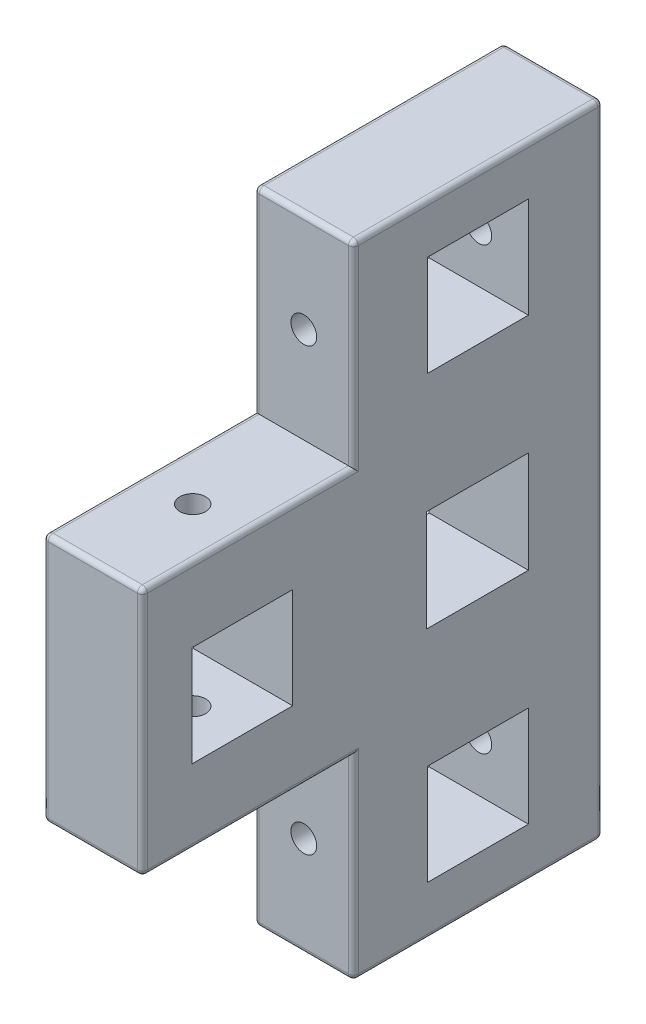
ISO-10303-21;
HEADER;
FILE_DESCRIPTION(('STEP AP214'),'2;1');
FILE_NAME('part.step','',(''),(''),'','','');
FILE_SCHEMA(('AUTOMOTIVE_DESIGN { 1 0 10303 214 1 1 1 1 }'));
ENDSEC;
DATA;
#1=APPLICATION_CONTEXT('core data for automotive mechanical design processes');
#2=APPLICATION_PROTOCOL_DEFINITION('international standard','automotive_design',2000,#1);
#3=PRODUCT_CONTEXT('',#1,'mechanical');
#4=PRODUCT('Part','Part','',(#3));
#5=PRODUCT_RELATED_PRODUCT_CATEGORY('part','',(#4));
#6=PRODUCT_DEFINITION_FORMATION('','',#4);
#7=PRODUCT_DEFINITION_CONTEXT('part definition',#1,'design');
#8=PRODUCT_DEFINITION('design','',#6,#7);
#9=PRODUCT_DEFINITION_SHAPE('','',#8);
#10=(LENGTH_UNIT() NAMED_UNIT(*) SI_UNIT(.MILLI.,.METRE.));
#11=(NAMED_UNIT(*) PLANE_ANGLE_UNIT() SI_UNIT($,.RADIAN.));
#12=(NAMED_UNIT(*) SI_UNIT($,.STERADIAN.) SOLID_ANGLE_UNIT());
#13=UNCERTAINTY_MEASURE_WITH_UNIT(LENGTH_MEASURE(1.E-05),#10,'distance_accuracy_value','');
#14=(GEOMETRIC_REPRESENTATION_CONTEXT(3) GLOBAL_UNCERTAINTY_ASSIGNED_CONTEXT((#13)) GLOBAL_UNIT_ASSIGNED_CONTEXT((#10,
#11,#12)) REPRESENTATION_CONTEXT('',''));
#15=CARTESIAN_POINT('',(0.,0.,0.));
#16=DIRECTION('',(0.,0.,1.));
#17=DIRECTION('',(1.,0.,0.));
#18=AXIS2_PLACEMENT_3D('',#15,#16,#17);
#19=CARTESIAN_POINT('',(10.,-17.1366386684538,2.47350316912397));
#20=DIRECTION('',(0.,0.,-1.));
#21=DIRECTION('',(0.,1.,0.));
#22=AXIS2_PLACEMENT_3D('',#19,#20,#21);
#23=PLANE('',#22);
#24=CARTESIAN_POINT('',(0.,-36.4366386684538,2.47350316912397));
#25=DIRECTION('',(0.,0.,-1.));
#26=DIRECTION('',(0.,1.,0.));
#27=AXIS2_PLACEMENT_3D('',#24,#25,#26);
#28=CIRCLE('',#27,2.6);
#29=CARTESIAN_POINT('',(0.,-33.8366386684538,2.47350316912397));
#30=VERTEX_POINT('',#29);
#31=EDGE_CURVE('E444',#30,#30,#28,.T.);
#32=ORIENTED_EDGE('',*,*,#31,.T.);
#33=EDGE_LOOP('',(#32));
#34=FACE_BOUND('',#33,.T.);
#35=DIRECTION('',(-1.,0.,0.));
#36=VECTOR('',#35,1.);
#37=CARTESIAN_POINT('',(10.,-17.1366386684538,2.47350316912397));
#38=LINE('',#37,#36);
#39=CARTESIAN_POINT('',(9.,-17.1366386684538,2.47350316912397));
#40=VERTEX_POINT('',#39);
#41=CARTESIAN_POINT('',(-9.,-17.1366386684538,2.47350316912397));
#42=VERTEX_POINT('',#41);
#43=EDGE_CURVE('E333',#40,#42,#38,.T.);
#44=ORIENTED_EDGE('',*,*,#43,.T.);
#45=DIRECTION('',(0.,-1.,0.));
#46=VECTOR('',#45,1.);
#47=CARTESIAN_POINT('',(-9.,-17.1366386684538,2.47350316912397));
#48=LINE('',#47,#46);
#49=CARTESIAN_POINT('',(-9.,-55.5866386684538,2.47350316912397));
#50=VERTEX_POINT('',#49);
#51=EDGE_CURVE('E489',#42,#50,#48,.T.);
#52=ORIENTED_EDGE('',*,*,#51,.T.);
#53=DIRECTION('',(-1.,0.,0.));
#54=VECTOR('',#53,1.);
#55=CARTESIAN_POINT('',(10.,-55.5866386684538,2.47350316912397));
#56=LINE('',#55,#54);
#57=CARTESIAN_POINT('',(9.,-55.5866386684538,2.47350316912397));
#58=VERTEX_POINT('',#57);
#59=EDGE_CURVE('E487',#50,#58,#56,.F.);
#60=ORIENTED_EDGE('',*,*,#59,.T.);
#61=DIRECTION('',(0.,-1.,0.));
#62=VECTOR('',#61,1.);
#63=CARTESIAN_POINT('',(9.,-17.1366386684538,2.47350316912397));
#64=LINE('',#63,#62);
#65=EDGE_CURVE('E482',#58,#40,#64,.F.);
#66=ORIENTED_EDGE('',*,*,#65,.T.);
#67=EDGE_LOOP('',(#44,#52,#60,#66));
#68=FACE_BOUND('',#67,.T.);
#69=ADVANCED_FACE('F43',(#34,#68),#23,.F.);
#70=CARTESIAN_POINT('',(10.,-56.5866386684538,2.47350316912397));
#71=DIRECTION('',(0.,1.,0.));
#72=DIRECTION('',(0.,0.,1.));
#73=AXIS2_PLACEMENT_3D('',#70,#71,#72);
#74=PLANE('',#73);
#75=DIRECTION('',(0.,0.,-1.));
#76=VECTOR('',#75,1.);
#77=CARTESIAN_POINT('',(-9.,-56.5866386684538,2.47350316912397));
#78=LINE('',#77,#76);
#79=CARTESIAN_POINT('',(-9.,-56.5866386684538,1.47350316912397));
#80=VERTEX_POINT('',#79);
#81=CARTESIAN_POINT('',(-9.,-56.5866386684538,-46.826496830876));
#82=VERTEX_POINT('',#81);
#83=EDGE_CURVE('E479',#80,#82,#78,.T.);
#84=ORIENTED_EDGE('',*,*,#83,.T.);
#85=DIRECTION('',(-1.,0.,0.));
#86=VECTOR('',#85,1.);
#87=CARTESIAN_POINT('',(10.,-56.5866386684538,-46.826496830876));
#88=LINE('',#87,#86);
#89=CARTESIAN_POINT('',(9.,-56.5866386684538,-46.826496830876));
#90=VERTEX_POINT('',#89);
#91=EDGE_CURVE('E485',#82,#90,#88,.F.);
#92=ORIENTED_EDGE('',*,*,#91,.T.);
#93=DIRECTION('',(0.,0.,-1.));
#94=VECTOR('',#93,1.);
#95=CARTESIAN_POINT('',(9.,-56.5866386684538,2.47350316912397));
#96=LINE('',#95,#94);
#97=CARTESIAN_POINT('',(9.,-56.5866386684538,1.47350316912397));
#98=VERTEX_POINT('',#97);
#99=EDGE_CURVE('E478',#90,#98,#96,.F.);
#100=ORIENTED_EDGE('',*,*,#99,.T.);
#101=DIRECTION('',(-1.,0.,0.));
#102=VECTOR('',#101,1.);
#103=CARTESIAN_POINT('',(10.,-56.5866386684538,1.47350316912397));
#104=LINE('',#103,#102);
#105=EDGE_CURVE('E476',#98,#80,#104,.T.);
#106=ORIENTED_EDGE('',*,*,#105,.T.);
#107=EDGE_LOOP('',(#84,#92,#100,#106));
#108=FACE_BOUND('',#107,.T.);
#109=ADVANCED_FACE('F703',(#108),#74,.F.);
#110=CARTESIAN_POINT('',(10.,-56.5866386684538,-47.826496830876));
#111=DIRECTION('',(0.,0.,1.));
#112=DIRECTION('',(1.,0.,0.));
#113=AXIS2_PLACEMENT_3D('',#110,#111,#112);
#114=PLANE('',#113);
#115=DIRECTION('',(-1.,0.,0.));
#116=VECTOR('',#115,1.);
#117=CARTESIAN_POINT('',(10.,-55.5866386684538,-47.826496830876));
#118=LINE('',#117,#116);
#119=CARTESIAN_POINT('',(9.,-55.5866386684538,-47.826496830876));
#120=VERTEX_POINT('',#119);
#121=CARTESIAN_POINT('',(-9.,-55.5866386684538,-47.826496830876));
#122=VERTEX_POINT('',#121);
#123=EDGE_CURVE('E453',#120,#122,#118,.T.);
#124=ORIENTED_EDGE('',*,*,#123,.T.);
#125=DIRECTION('',(0.,1.,0.));
#126=VECTOR('',#125,1.);
#127=CARTESIAN_POINT('',(-9.,-56.5866386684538,-47.826496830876));
#128=LINE('',#127,#126);
#129=CARTESIAN_POINT('',(-9.,71.6133613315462,-47.826496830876));
#130=VERTEX_POINT('',#129);
#131=EDGE_CURVE('E458',#122,#130,#128,.T.);
#132=ORIENTED_EDGE('',*,*,#131,.T.);
#133=DIRECTION('',(-1.,0.,0.));
#134=VECTOR('',#133,1.);
#135=CARTESIAN_POINT('',(10.,71.6133613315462,-47.826496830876));
#136=LINE('',#135,#134);
#137=CARTESIAN_POINT('',(9.,71.6133613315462,-47.826496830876));
#138=VERTEX_POINT('',#137);
#139=EDGE_CURVE('E451',#130,#138,#136,.F.);
#140=ORIENTED_EDGE('',*,*,#139,.T.);
#141=DIRECTION('',(0.,1.,0.));
#142=VECTOR('',#141,1.);
#143=CARTESIAN_POINT('',(9.,-56.5866386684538,-47.826496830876));
#144=LINE('',#143,#142);
#145=EDGE_CURVE('E434',#138,#120,#144,.F.);
#146=ORIENTED_EDGE('',*,*,#145,.T.);
#147=EDGE_LOOP('',(#124,#132,#140,#146));
#148=FACE_BOUND('',#147,.T.);
#149=CARTESIAN_POINT('',(0.,-36.4366386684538,-47.826496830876));
#150=DIRECTION('',(0.,0.,-1.));
#151=DIRECTION('',(-1.,0.,0.));
#152=AXIS2_PLACEMENT_3D('',#149,#150,#151);
#153=CIRCLE('',#152,2.6);
#154=CARTESIAN_POINT('',(-2.6,-36.4366386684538,-47.826496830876));
#155=VERTEX_POINT('',#154);
#156=EDGE_CURVE('E439',#155,#155,#153,.T.);
#157=ORIENTED_EDGE('',*,*,#156,.F.);
#158=EDGE_LOOP('',(#157));
#159=FACE_BOUND('',#158,.T.);
#160=CARTESIAN_POINT('',(0.,52.4633613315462,-47.826496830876));
#161=DIRECTION('',(0.,0.,-1.));
#162=DIRECTION('',(-1.,0.,0.));
#163=AXIS2_PLACEMENT_3D('',#160,#161,#162);
#164=CIRCLE('',#163,2.6);
#165=CARTESIAN_POINT('',(-2.6,52.4633613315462,-47.826496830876));
#166=VERTEX_POINT('',#165);
#167=EDGE_CURVE('E668',#166,#166,#164,.T.);
#168=ORIENTED_EDGE('',*,*,#167,.F.);
#169=EDGE_LOOP('',(#168));
#170=FACE_BOUND('',#169,.T.);
#171=ADVANCED_FACE('F714',(#148,#159,#170),#114,.F.);
#172=CARTESIAN_POINT('',(10.,72.6133613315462,-47.826496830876));
#173=DIRECTION('',(0.,-1.,0.));
#174=DIRECTION('',(0.,0.,-1.));
#175=AXIS2_PLACEMENT_3D('',#172,#173,#174);
#176=PLANE('',#175);
#177=DIRECTION('',(-1.,0.,0.));
#178=VECTOR('',#177,1.);
#179=CARTESIAN_POINT('',(10.,72.6133613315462,-46.826496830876));
#180=LINE('',#179,#178);
#181=CARTESIAN_POINT('',(9.,72.6133613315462,-46.826496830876));
#182=VERTEX_POINT('',#181);
#183=CARTESIAN_POINT('',(-9.,72.6133613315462,-46.826496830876));
#184=VERTEX_POINT('',#183);
#185=EDGE_CURVE('E525',#182,#184,#180,.T.);
#186=ORIENTED_EDGE('',*,*,#185,.T.);
#187=DIRECTION('',(0.,0.,1.));
#188=VECTOR('',#187,1.);
#189=CARTESIAN_POINT('',(-9.,72.6133613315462,-47.826496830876));
#190=LINE('',#189,#188);
#191=CARTESIAN_POINT('',(-9.,72.6133613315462,1.47350316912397));
#192=VERTEX_POINT('',#191);
#193=EDGE_CURVE('E528',#184,#192,#190,.T.);
#194=ORIENTED_EDGE('',*,*,#193,.T.);
#195=DIRECTION('',(-1.,0.,0.));
#196=VECTOR('',#195,1.);
#197=CARTESIAN_POINT('',(10.,72.6133613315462,1.47350316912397));
#198=LINE('',#197,#196);
#199=CARTESIAN_POINT('',(9.,72.6133613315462,1.47350316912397));
#200=VERTEX_POINT('',#199);
#201=EDGE_CURVE('E522',#192,#200,#198,.F.);
#202=ORIENTED_EDGE('',*,*,#201,.T.);
#203=DIRECTION('',(0.,0.,1.));
#204=VECTOR('',#203,1.);
#205=CARTESIAN_POINT('',(9.,72.6133613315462,-47.826496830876));
#206=LINE('',#205,#204);
#207=EDGE_CURVE('E517',#200,#182,#206,.F.);
#208=ORIENTED_EDGE('',*,*,#207,.T.);
#209=EDGE_LOOP('',(#186,#194,#202,#208));
#210=FACE_BOUND('',#209,.T.);
#211=ADVANCED_FACE('F938',(#210),#176,.F.);
#212=CARTESIAN_POINT('',(10.,72.6133613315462,2.47350316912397));
#213=DIRECTION('',(0.,0.,-1.));
#214=DIRECTION('',(0.,1.,0.));
#215=AXIS2_PLACEMENT_3D('',#212,#213,#214);
#216=PLANE('',#215);
#217=CARTESIAN_POINT('',(0.,52.4633613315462,2.47350316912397));
#218=DIRECTION('',(0.,0.,-1.));
#219=DIRECTION('',(0.,1.,0.));
#220=AXIS2_PLACEMENT_3D('',#217,#218,#219);
#221=CIRCLE('',#220,2.6);
#222=CARTESIAN_POINT('',(0.,55.0633613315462,2.47350316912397));
#223=VERTEX_POINT('',#222);
#224=EDGE_CURVE('E319',#223,#223,#221,.T.);
#225=ORIENTED_EDGE('',*,*,#224,.T.);
#226=EDGE_LOOP('',(#225));
#227=FACE_BOUND('',#226,.T.);
#228=DIRECTION('',(-1.,0.,0.));
#229=VECTOR('',#228,1.);
#230=CARTESIAN_POINT('',(10.,71.6133613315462,2.47350316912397));
#231=LINE('',#230,#229);
#232=CARTESIAN_POINT('',(9.,71.6133613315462,2.47350316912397));
#233=VERTEX_POINT('',#232);
#234=CARTESIAN_POINT('',(-9.,71.6133613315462,2.47350316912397));
#235=VERTEX_POINT('',#234);
#236=EDGE_CURVE('E519',#233,#235,#231,.T.);
#237=ORIENTED_EDGE('',*,*,#236,.T.);
#238=DIRECTION('',(0.,-1.,0.));
#239=VECTOR('',#238,1.);
#240=CARTESIAN_POINT('',(-9.,72.6133613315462,2.47350316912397));
#241=LINE('',#240,#239);
#242=CARTESIAN_POINT('',(-9.,33.1633613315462,2.47350316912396));
#243=VERTEX_POINT('',#242);
#244=EDGE_CURVE('E520',#235,#243,#241,.T.);
#245=ORIENTED_EDGE('',*,*,#244,.T.);
#246=DIRECTION('',(-1.,0.,0.));
#247=VECTOR('',#246,1.);
#248=CARTESIAN_POINT('',(10.,33.1633613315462,2.47350316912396));
#249=LINE('',#248,#247);
#250=CARTESIAN_POINT('',(9.,33.1633613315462,2.47350316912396));
#251=VERTEX_POINT('',#250);
#252=EDGE_CURVE('E435',#251,#243,#249,.T.);
#253=ORIENTED_EDGE('',*,*,#252,.F.);
#254=DIRECTION('',(0.,-1.,0.));
#255=VECTOR('',#254,1.);
#256=CARTESIAN_POINT('',(9.,72.6133613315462,2.47350316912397));
#257=LINE('',#256,#255);
#258=EDGE_CURVE('E511',#251,#233,#257,.F.);
#259=ORIENTED_EDGE('',*,*,#258,.T.);
#260=EDGE_LOOP('',(#237,#245,#253,#259));
#261=FACE_BOUND('',#260,.T.);
#262=ADVANCED_FACE('F681',(#227,#261),#216,.F.);
#263=CARTESIAN_POINT('',(10.,33.1633613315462,2.47350316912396));
#264=DIRECTION('',(0.,-1.,0.));
#265=DIRECTION('',(0.,0.,-1.));
#266=AXIS2_PLACEMENT_3D('',#263,#264,#265);
#267=PLANE('',#266);
#268=CARTESIAN_POINT('',(0.,33.1633613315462,24.873503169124));
#269=DIRECTION('',(0.,-1.,0.));
#270=DIRECTION('',(0.,0.,-1.));
#271=AXIS2_PLACEMENT_3D('',#268,#269,#270);
#272=CIRCLE('',#271,2.6);
#273=CARTESIAN_POINT('',(0.,33.1633613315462,22.273503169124));
#274=VERTEX_POINT('',#273);
#275=EDGE_CURVE('E669',#274,#274,#272,.T.);
#276=ORIENTED_EDGE('',*,*,#275,.T.);
#277=EDGE_LOOP('',(#276));
#278=FACE_BOUND('',#277,.T.);
#279=ORIENTED_EDGE('',*,*,#252,.T.);
#280=DIRECTION('',(0.,0.,1.));
#281=VECTOR('',#280,1.);
#282=CARTESIAN_POINT('',(-9.,33.1633613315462,2.47350316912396));
#283=LINE('',#282,#281);
#284=CARTESIAN_POINT('',(-9.,33.1633613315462,44.0235031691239));
#285=VERTEX_POINT('',#284);
#286=EDGE_CURVE('E515',#243,#285,#283,.T.);
#287=ORIENTED_EDGE('',*,*,#286,.T.);
#288=DIRECTION('',(-1.,0.,0.));
#289=VECTOR('',#288,1.);
#290=CARTESIAN_POINT('',(10.,33.1633613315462,44.0235031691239));
#291=LINE('',#290,#289);
#292=CARTESIAN_POINT('',(9.,33.1633613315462,44.0235031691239));
#293=VERTEX_POINT('',#292);
#294=EDGE_CURVE('E508',#285,#293,#291,.F.);
#295=ORIENTED_EDGE('',*,*,#294,.T.);
#296=DIRECTION('',(0.,0.,1.));
#297=VECTOR('',#296,1.);
#298=CARTESIAN_POINT('',(9.,33.1633613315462,2.47350316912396));
#299=LINE('',#298,#297);
#300=EDGE_CURVE('E510',#293,#251,#299,.F.);
#301=ORIENTED_EDGE('',*,*,#300,.T.);
#302=EDGE_LOOP('',(#279,#287,#295,#301));
#303=FACE_BOUND('',#302,.T.);
#304=ADVANCED_FACE('F901',(#278,#303),#267,.F.);
#305=CARTESIAN_POINT('',(10.,33.1633613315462,45.0235031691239));
#306=DIRECTION('',(0.,0.,-1.));
#307=DIRECTION('',(-1.,0.,0.));
#308=AXIS2_PLACEMENT_3D('',#305,#306,#307);
#309=PLANE('',#308);
#310=DIRECTION('',(0.,-1.,0.));
#311=VECTOR('',#310,1.);
#312=CARTESIAN_POINT('',(-9.,33.1633613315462,45.0235031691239));
#313=LINE('',#312,#311);
#314=CARTESIAN_POINT('',(-9.,32.1633613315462,45.0235031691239));
#315=VERTEX_POINT('',#314);
#316=CARTESIAN_POINT('',(-9.,-16.1366386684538,45.0235031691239));
#317=VERTEX_POINT('',#316);
#318=EDGE_CURVE('E505',#315,#317,#313,.T.);
#319=ORIENTED_EDGE('',*,*,#318,.T.);
#320=DIRECTION('',(-1.,0.,0.));
#321=VECTOR('',#320,1.);
#322=CARTESIAN_POINT('',(10.,-16.1366386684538,45.0235031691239));
#323=LINE('',#322,#321);
#324=CARTESIAN_POINT('',(9.,-16.1366386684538,45.0235031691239));
#325=VERTEX_POINT('',#324);
#326=EDGE_CURVE('E502',#317,#325,#323,.F.);
#327=ORIENTED_EDGE('',*,*,#326,.T.);
#328=DIRECTION('',(0.,-1.,0.));
#329=VECTOR('',#328,1.);
#330=CARTESIAN_POINT('',(9.,33.1633613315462,45.0235031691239));
#331=LINE('',#330,#329);
#332=CARTESIAN_POINT('',(9.,32.1633613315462,45.0235031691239));
#333=VERTEX_POINT('',#332);
#334=EDGE_CURVE('E498',#325,#333,#331,.F.);
#335=ORIENTED_EDGE('',*,*,#334,.T.);
#336=DIRECTION('',(-1.,0.,0.));
#337=VECTOR('',#336,1.);
#338=CARTESIAN_POINT('',(10.,32.1633613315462,45.0235031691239));
#339=LINE('',#338,#337);
#340=EDGE_CURVE('E499',#333,#315,#339,.T.);
#341=ORIENTED_EDGE('',*,*,#340,.T.);
#342=EDGE_LOOP('',(#319,#327,#335,#341));
#343=FACE_BOUND('',#342,.T.);
#344=ADVANCED_FACE('F861',(#343),#309,.F.);
#345=CARTESIAN_POINT('',(10.,-17.1366386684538,45.0235031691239));
#346=DIRECTION('',(0.,1.,0.));
#347=DIRECTION('',(0.,0.,1.));
#348=AXIS2_PLACEMENT_3D('',#345,#346,#347);
#349=PLANE('',#348);
#350=CARTESIAN_POINT('',(0.,-17.1366386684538,24.8735031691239));
#351=DIRECTION('',(0.,-1.,0.));
#352=DIRECTION('',(0.,0.,-1.));
#353=AXIS2_PLACEMENT_3D('',#350,#351,#352);
#354=CIRCLE('',#353,2.6);
#355=CARTESIAN_POINT('',(0.,-17.1366386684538,22.2735031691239));
#356=VERTEX_POINT('',#355);
#357=EDGE_CURVE('E448',#356,#356,#354,.T.);
#358=ORIENTED_EDGE('',*,*,#357,.F.);
#359=EDGE_LOOP('',(#358));
#360=FACE_BOUND('',#359,.T.);
#361=DIRECTION('',(-1.,0.,0.));
#362=VECTOR('',#361,1.);
#363=CARTESIAN_POINT('',(10.,-17.1366386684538,44.0235031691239));
#364=LINE('',#363,#362);
#365=CARTESIAN_POINT('',(9.,-17.1366386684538,44.0235031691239));
#366=VERTEX_POINT('',#365);
#367=CARTESIAN_POINT('',(-9.,-17.1366386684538,44.0235031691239));
#368=VERTEX_POINT('',#367);
#369=EDGE_CURVE('E494',#366,#368,#364,.T.);
#370=ORIENTED_EDGE('',*,*,#369,.T.);
#371=DIRECTION('',(0.,0.,-1.));
#372=VECTOR('',#371,1.);
#373=CARTESIAN_POINT('',(-9.,-17.1366386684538,45.0235031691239));
#374=LINE('',#373,#372);
#375=EDGE_CURVE('E496',#368,#42,#374,.T.);
#376=ORIENTED_EDGE('',*,*,#375,.T.);
#377=ORIENTED_EDGE('',*,*,#43,.F.);
#378=DIRECTION('',(0.,0.,-1.));
#379=VECTOR('',#378,1.);
#380=CARTESIAN_POINT('',(9.,-17.1366386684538,45.0235031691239));
#381=LINE('',#380,#379);
#382=EDGE_CURVE('E495',#40,#366,#381,.F.);
#383=ORIENTED_EDGE('',*,*,#382,.T.);
#384=EDGE_LOOP('',(#370,#376,#377,#383));
#385=FACE_BOUND('',#384,.T.);
#386=ADVANCED_FACE('F878',(#360,#385),#349,.F.);
#387=CARTESIAN_POINT('',(10.,0.,0.));
#388=DIRECTION('',(1.,0.,0.));
#389=DIRECTION('',(0.,0.,-1.));
#390=AXIS2_PLACEMENT_3D('',#387,#388,#389);
#391=PLANE('',#390);
#392=DIRECTION('',(0.,1.,0.));
#393=VECTOR('',#392,1.);
#394=CARTESIAN_POINT('',(10.,72.6133613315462,-46.826496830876));
#395=LINE('',#394,#393);
#396=CARTESIAN_POINT('',(10.,-55.5866386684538,-46.826496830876));
#397=VERTEX_POINT('',#396);
#398=CARTESIAN_POINT('',(10.,71.6133613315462,-46.826496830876));
#399=VERTEX_POINT('',#398);
#400=EDGE_CURVE('E55',#397,#399,#395,.T.);
#401=ORIENTED_EDGE('',*,*,#400,.T.);
#402=DIRECTION('',(0.,0.,1.));
#403=VECTOR('',#402,1.);
#404=CARTESIAN_POINT('',(10.,71.6133613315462,2.47350316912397));
#405=LINE('',#404,#403);
#406=CARTESIAN_POINT('',(10.,71.6133613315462,1.47350316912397));
#407=VERTEX_POINT('',#406);
#408=EDGE_CURVE('E11',#399,#407,#405,.T.);
#409=ORIENTED_EDGE('',*,*,#408,.T.);
#410=DIRECTION('',(0.,-1.,0.));
#411=VECTOR('',#410,1.);
#412=CARTESIAN_POINT('',(10.,33.1633613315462,1.47350316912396));
#413=LINE('',#412,#411);
#414=CARTESIAN_POINT('',(10.,32.1633613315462,1.47350316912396));
#415=VERTEX_POINT('',#414);
#416=EDGE_CURVE('E532',#407,#415,#413,.T.);
#417=ORIENTED_EDGE('',*,*,#416,.T.);
#418=DIRECTION('',(0.,0.,1.));
#419=VECTOR('',#418,1.);
#420=CARTESIAN_POINT('',(10.,32.1633613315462,45.0235031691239));
#421=LINE('',#420,#419);
#422=CARTESIAN_POINT('',(10.,32.1633613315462,44.0235031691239));
#423=VERTEX_POINT('',#422);
#424=EDGE_CURVE('E529',#415,#423,#421,.T.);
#425=ORIENTED_EDGE('',*,*,#424,.T.);
#426=DIRECTION('',(0.,-1.,0.));
#427=VECTOR('',#426,1.);
#428=CARTESIAN_POINT('',(10.,-17.1366386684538,44.0235031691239));
#429=LINE('',#428,#427);
#430=CARTESIAN_POINT('',(10.,-16.1366386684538,44.0235031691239));
#431=VERTEX_POINT('',#430);
#432=EDGE_CURVE('E531',#423,#431,#429,.T.);
#433=ORIENTED_EDGE('',*,*,#432,.T.);
#434=DIRECTION('',(0.,0.,-1.));
#435=VECTOR('',#434,1.);
#436=CARTESIAN_POINT('',(10.,-16.1366386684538,2.47350316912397));
#437=LINE('',#436,#435);
#438=CARTESIAN_POINT('',(10.,-16.1366386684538,1.47350316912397));
#439=VERTEX_POINT('',#438);
#440=EDGE_CURVE('E533',#431,#439,#437,.T.);
#441=ORIENTED_EDGE('',*,*,#440,.T.);
#442=DIRECTION('',(0.,-1.,0.));
#443=VECTOR('',#442,1.);
#444=CARTESIAN_POINT('',(10.,-56.5866386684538,1.47350316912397));
#445=LINE('',#444,#443);
#446=CARTESIAN_POINT('',(10.,-55.5866386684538,1.47350316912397));
#447=VERTEX_POINT('',#446);
#448=EDGE_CURVE('E536',#439,#447,#445,.T.);
#449=ORIENTED_EDGE('',*,*,#448,.T.);
#450=DIRECTION('',(0.,0.,-1.));
#451=VECTOR('',#450,1.);
#452=CARTESIAN_POINT('',(10.,-55.5866386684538,-47.826496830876));
#453=LINE('',#452,#451);
#454=EDGE_CURVE('E65',#447,#397,#453,.T.);
#455=ORIENTED_EDGE('',*,*,#454,.T.);
#456=EDGE_LOOP('',(#401,#409,#417,#425,#433,#441,#449,#455));
#457=FACE_BOUND('',#456,.T.);
#458=DIRECTION('',(0.,0.,1.));
#459=VECTOR('',#458,1.);
#460=CARTESIAN_POINT('',(10.,18.1633613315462,35.0235031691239));
#461=LINE('',#460,#459);
#462=CARTESIAN_POINT('',(10.,18.1633613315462,14.7235031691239));
#463=VERTEX_POINT('',#462);
#464=CARTESIAN_POINT('',(10.,18.1633613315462,35.0235031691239));
#465=VERTEX_POINT('',#464);
#466=EDGE_CURVE('E295',#463,#465,#461,.T.);
#467=ORIENTED_EDGE('',*,*,#466,.F.);
#468=DIRECTION('',(0.,1.,0.));
#469=VECTOR('',#468,1.);
#470=CARTESIAN_POINT('',(10.,-2.13663866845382,14.7235031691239));
#471=LINE('',#470,#469);
#472=CARTESIAN_POINT('',(10.,-2.13663866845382,14.7235031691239));
#473=VERTEX_POINT('',#472);
#474=EDGE_CURVE('E315',#473,#463,#471,.T.);
#475=ORIENTED_EDGE('',*,*,#474,.F.);
#476=DIRECTION('',(0.,0.,-1.));
#477=VECTOR('',#476,1.);
#478=CARTESIAN_POINT('',(10.,-2.13663866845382,35.0235031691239));
#479=LINE('',#478,#477);
#480=CARTESIAN_POINT('',(10.,-2.13663866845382,35.0235031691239));
#481=VERTEX_POINT('',#480);
#482=EDGE_CURVE('E314',#481,#473,#479,.T.);
#483=ORIENTED_EDGE('',*,*,#482,.F.);
#484=DIRECTION('',(0.,-1.,0.));
#485=VECTOR('',#484,1.);
#486=CARTESIAN_POINT('',(10.,-2.13663866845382,35.0235031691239));
#487=LINE('',#486,#485);
#488=EDGE_CURVE('E323',#465,#481,#487,.T.);
#489=ORIENTED_EDGE('',*,*,#488,.F.);
#490=EDGE_LOOP('',(#467,#475,#483,#489));
#491=FACE_BOUND('',#490,.T.);
#492=DIRECTION('',(0.,0.,1.));
#493=VECTOR('',#492,1.);
#494=CARTESIAN_POINT('',(10.,18.2633613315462,-12.326496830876));
#495=LINE('',#494,#493);
#496=CARTESIAN_POINT('',(10.,18.2633613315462,-32.826496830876));
#497=VERTEX_POINT('',#496);
#498=CARTESIAN_POINT('',(10.,18.2633613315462,-12.326496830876));
#499=VERTEX_POINT('',#498);
#500=EDGE_CURVE('E322',#497,#499,#495,.T.);
#501=ORIENTED_EDGE('',*,*,#500,.F.);
#502=DIRECTION('',(0.,1.,0.));
#503=VECTOR('',#502,1.);
#504=CARTESIAN_POINT('',(10.,-2.23663866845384,-32.826496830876));
#505=LINE('',#504,#503);
#506=CARTESIAN_POINT('',(10.,-2.23663866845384,-32.826496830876));
#507=VERTEX_POINT('',#506);
#508=EDGE_CURVE('E348',#507,#497,#505,.T.);
#509=ORIENTED_EDGE('',*,*,#508,.F.);
#510=DIRECTION('',(0.,0.,-1.));
#511=VECTOR('',#510,1.);
#512=CARTESIAN_POINT('',(10.,-2.23663866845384,-12.326496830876));
#513=LINE('',#512,#511);
#514=CARTESIAN_POINT('',(10.,-2.23663866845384,-12.326496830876));
#515=VERTEX_POINT('',#514);
#516=EDGE_CURVE('E347',#515,#507,#513,.T.);
#517=ORIENTED_EDGE('',*,*,#516,.F.);
#518=DIRECTION('',(0.,-1.,0.));
#519=VECTOR('',#518,1.);
#520=CARTESIAN_POINT('',(10.,-2.23663866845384,-12.326496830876));
#521=LINE('',#520,#519);
#522=EDGE_CURVE('E351',#499,#515,#521,.T.);
#523=ORIENTED_EDGE('',*,*,#522,.F.);
#524=EDGE_LOOP('',(#501,#509,#517,#523));
#525=FACE_BOUND('',#524,.T.);
#526=DIRECTION('',(0.,0.,1.));
#527=VECTOR('',#526,1.);
#528=CARTESIAN_POINT('',(10.,-26.2866386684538,-12.526496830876));
#529=LINE('',#528,#527);
#530=CARTESIAN_POINT('',(10.,-26.2866386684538,-32.826496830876));
#531=VERTEX_POINT('',#530);
#532=CARTESIAN_POINT('',(10.,-26.2866386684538,-12.526496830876));
#533=VERTEX_POINT('',#532);
#534=EDGE_CURVE('E342',#531,#533,#529,.T.);
#535=ORIENTED_EDGE('',*,*,#534,.F.);
#536=DIRECTION('',(0.,1.,0.));
#537=VECTOR('',#536,1.);
#538=CARTESIAN_POINT('',(10.,-46.5866386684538,-32.826496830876));
#539=LINE('',#538,#537);
#540=CARTESIAN_POINT('',(10.,-46.5866386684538,-32.826496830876));
#541=VERTEX_POINT('',#540);
#542=EDGE_CURVE('E377',#541,#531,#539,.T.);
#543=ORIENTED_EDGE('',*,*,#542,.F.);
#544=DIRECTION('',(0.,0.,-1.));
#545=VECTOR('',#544,1.);
#546=CARTESIAN_POINT('',(10.,-46.5866386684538,-12.526496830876));
#547=LINE('',#546,#545);
#548=CARTESIAN_POINT('',(10.,-46.5866386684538,-12.526496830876));
#549=VERTEX_POINT('',#548);
#550=EDGE_CURVE('E382',#549,#541,#547,.T.);
#551=ORIENTED_EDGE('',*,*,#550,.F.);
#552=DIRECTION('',(0.,-1.,0.));
#553=VECTOR('',#552,1.);
#554=CARTESIAN_POINT('',(10.,-46.5866386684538,-12.526496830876));
#555=LINE('',#554,#553);
#556=EDGE_CURVE('E383',#533,#549,#555,.T.);
#557=ORIENTED_EDGE('',*,*,#556,.F.);
#558=EDGE_LOOP('',(#535,#543,#551,#557));
#559=FACE_BOUND('',#558,.T.);
#560=DIRECTION('',(0.,0.,1.));
#561=VECTOR('',#560,1.);
#562=CARTESIAN_POINT('',(10.,62.6133613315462,-12.526496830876));
#563=LINE('',#562,#561);
#564=CARTESIAN_POINT('',(10.,62.6133613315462,-32.826496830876));
#565=VERTEX_POINT('',#564);
#566=CARTESIAN_POINT('',(10.,62.6133613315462,-12.526496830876));
#567=VERTEX_POINT('',#566);
#568=EDGE_CURVE('E380',#565,#567,#563,.T.);
#569=ORIENTED_EDGE('',*,*,#568,.F.);
#570=DIRECTION('',(0.,1.,0.));
#571=VECTOR('',#570,1.);
#572=CARTESIAN_POINT('',(10.,42.3133613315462,-32.826496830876));
#573=LINE('',#572,#571);
#574=CARTESIAN_POINT('',(10.,42.3133613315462,-32.826496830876));
#575=VERTEX_POINT('',#574);
#576=EDGE_CURVE('E408',#575,#565,#573,.T.);
#577=ORIENTED_EDGE('',*,*,#576,.F.);
#578=DIRECTION('',(0.,0.,-1.));
#579=VECTOR('',#578,1.);
#580=CARTESIAN_POINT('',(10.,42.3133613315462,-12.526496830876));
#581=LINE('',#580,#579);
#582=CARTESIAN_POINT('',(10.,42.3133613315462,-12.526496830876));
#583=VERTEX_POINT('',#582);
#584=EDGE_CURVE('E415',#583,#575,#581,.T.);
#585=ORIENTED_EDGE('',*,*,#584,.F.);
#586=DIRECTION('',(0.,-1.,0.));
#587=VECTOR('',#586,1.);
#588=CARTESIAN_POINT('',(10.,42.3133613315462,-12.526496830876));
#589=LINE('',#588,#587);
#590=EDGE_CURVE('E418',#567,#583,#589,.T.);
#591=ORIENTED_EDGE('',*,*,#590,.F.);
#592=EDGE_LOOP('',(#569,#577,#585,#591));
#593=FACE_BOUND('',#592,.T.);
#594=ADVANCED_FACE('F852',(#457,#491,#525,#559,#593),#391,.T.);
#595=CARTESIAN_POINT('',(-10.,0.,0.));
#596=DIRECTION('',(1.,0.,0.));
#597=DIRECTION('',(0.,0.,-1.));
#598=AXIS2_PLACEMENT_3D('',#595,#596,#597);
#599=PLANE('',#598);
#600=DIRECTION('',(0.,0.,1.));
#601=VECTOR('',#600,1.);
#602=CARTESIAN_POINT('',(-10.,71.6133613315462,0.));
#603=LINE('',#602,#601);
#604=CARTESIAN_POINT('',(-10.,71.6133613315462,1.47350316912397));
#605=VERTEX_POINT('',#604);
#606=CARTESIAN_POINT('',(-10.,71.6133613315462,-46.826496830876));
#607=VERTEX_POINT('',#606);
#608=EDGE_CURVE('E457',#605,#607,#603,.F.);
#609=ORIENTED_EDGE('',*,*,#608,.T.);
#610=DIRECTION('',(0.,1.,0.));
#611=VECTOR('',#610,1.);
#612=CARTESIAN_POINT('',(-10.,0.,-46.826496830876));
#613=LINE('',#612,#611);
#614=CARTESIAN_POINT('',(-10.,-55.5866386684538,-46.826496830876));
#615=VERTEX_POINT('',#614);
#616=EDGE_CURVE('E475',#607,#615,#613,.F.);
#617=ORIENTED_EDGE('',*,*,#616,.T.);
#618=DIRECTION('',(0.,0.,-1.));
#619=VECTOR('',#618,1.);
#620=CARTESIAN_POINT('',(-10.,-55.5866386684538,0.));
#621=LINE('',#620,#619);
#622=CARTESIAN_POINT('',(-10.,-55.5866386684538,1.47350316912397));
#623=VERTEX_POINT('',#622);
#624=EDGE_CURVE('E474',#615,#623,#621,.F.);
#625=ORIENTED_EDGE('',*,*,#624,.T.);
#626=DIRECTION('',(0.,-1.,0.));
#627=VECTOR('',#626,1.);
#628=CARTESIAN_POINT('',(-10.,0.,1.47350316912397));
#629=LINE('',#628,#627);
#630=CARTESIAN_POINT('',(-10.,-16.1366386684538,1.47350316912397));
#631=VERTEX_POINT('',#630);
#632=EDGE_CURVE('E469',#623,#631,#629,.F.);
#633=ORIENTED_EDGE('',*,*,#632,.T.);
#634=DIRECTION('',(0.,0.,-1.));
#635=VECTOR('',#634,1.);
#636=CARTESIAN_POINT('',(-10.,-16.1366386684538,0.));
#637=LINE('',#636,#635);
#638=CARTESIAN_POINT('',(-10.,-16.1366386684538,44.0235031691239));
#639=VERTEX_POINT('',#638);
#640=EDGE_CURVE('E470',#631,#639,#637,.F.);
#641=ORIENTED_EDGE('',*,*,#640,.T.);
#642=DIRECTION('',(0.,-1.,0.));
#643=VECTOR('',#642,1.);
#644=CARTESIAN_POINT('',(-10.,0.,44.0235031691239));
#645=LINE('',#644,#643);
#646=CARTESIAN_POINT('',(-10.,32.1633613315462,44.0235031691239));
#647=VERTEX_POINT('',#646);
#648=EDGE_CURVE('E462',#639,#647,#645,.F.);
#649=ORIENTED_EDGE('',*,*,#648,.T.);
#650=DIRECTION('',(0.,0.,1.));
#651=VECTOR('',#650,1.);
#652=CARTESIAN_POINT('',(-10.,32.1633613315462,0.));
#653=LINE('',#652,#651);
#654=CARTESIAN_POINT('',(-10.,32.1633613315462,1.47350316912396));
#655=VERTEX_POINT('',#654);
#656=EDGE_CURVE('E461',#647,#655,#653,.F.);
#657=ORIENTED_EDGE('',*,*,#656,.T.);
#658=DIRECTION('',(0.,-1.,0.));
#659=VECTOR('',#658,1.);
#660=CARTESIAN_POINT('',(-10.,0.,1.47350316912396));
#661=LINE('',#660,#659);
#662=EDGE_CURVE('E463',#655,#605,#661,.F.);
#663=ORIENTED_EDGE('',*,*,#662,.T.);
#664=EDGE_LOOP('',(#609,#617,#625,#633,#641,#649,#657,#663));
#665=FACE_BOUND('',#664,.T.);
#666=DIRECTION('',(0.,1.,0.));
#667=VECTOR('',#666,1.);
#668=CARTESIAN_POINT('',(-10.,-2.13663866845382,14.7235031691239));
#669=LINE('',#668,#667);
#670=CARTESIAN_POINT('',(-10.,-2.13663866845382,14.7235031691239));
#671=VERTEX_POINT('',#670);
#672=CARTESIAN_POINT('',(-10.,18.1633613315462,14.7235031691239));
#673=VERTEX_POINT('',#672);
#674=EDGE_CURVE('E299',#671,#673,#669,.T.);
#675=ORIENTED_EDGE('',*,*,#674,.T.);
#676=DIRECTION('',(0.,0.,1.));
#677=VECTOR('',#676,1.);
#678=CARTESIAN_POINT('',(-10.,18.1633613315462,35.0235031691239));
#679=LINE('',#678,#677);
#680=CARTESIAN_POINT('',(-10.,18.1633613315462,35.0235031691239));
#681=VERTEX_POINT('',#680);
#682=EDGE_CURVE('E293',#673,#681,#679,.T.);
#683=ORIENTED_EDGE('',*,*,#682,.T.);
#684=DIRECTION('',(0.,-1.,0.));
#685=VECTOR('',#684,1.);
#686=CARTESIAN_POINT('',(-10.,-2.13663866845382,35.0235031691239));
#687=LINE('',#686,#685);
#688=CARTESIAN_POINT('',(-10.,-2.13663866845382,35.0235031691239));
#689=VERTEX_POINT('',#688);
#690=EDGE_CURVE('E303',#681,#689,#687,.T.);
#691=ORIENTED_EDGE('',*,*,#690,.T.);
#692=DIRECTION('',(0.,0.,-1.));
#693=VECTOR('',#692,1.);
#694=CARTESIAN_POINT('',(-10.,-2.13663866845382,35.0235031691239));
#695=LINE('',#694,#693);
#696=EDGE_CURVE('E310',#689,#671,#695,.T.);
#697=ORIENTED_EDGE('',*,*,#696,.T.);
#698=EDGE_LOOP('',(#675,#683,#691,#697));
#699=FACE_BOUND('',#698,.T.);
#700=DIRECTION('',(0.,1.,0.));
#701=VECTOR('',#700,1.);
#702=CARTESIAN_POINT('',(-10.,-2.23663866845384,-32.826496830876));
#703=LINE('',#702,#701);
#704=CARTESIAN_POINT('',(-10.,-2.23663866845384,-32.826496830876));
#705=VERTEX_POINT('',#704);
#706=CARTESIAN_POINT('',(-10.,18.2633613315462,-32.826496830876));
#707=VERTEX_POINT('',#706);
#708=EDGE_CURVE('E336',#705,#707,#703,.T.);
#709=ORIENTED_EDGE('',*,*,#708,.T.);
#710=DIRECTION('',(0.,0.,1.));
#711=VECTOR('',#710,1.);
#712=CARTESIAN_POINT('',(-10.,18.2633613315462,-12.326496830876));
#713=LINE('',#712,#711);
#714=CARTESIAN_POINT('',(-10.,18.2633613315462,-12.326496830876));
#715=VERTEX_POINT('',#714);
#716=EDGE_CURVE('E349',#707,#715,#713,.T.);
#717=ORIENTED_EDGE('',*,*,#716,.T.);
#718=DIRECTION('',(0.,-1.,0.));
#719=VECTOR('',#718,1.);
#720=CARTESIAN_POINT('',(-10.,-2.23663866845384,-12.326496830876));
#721=LINE('',#720,#719);
#722=CARTESIAN_POINT('',(-10.,-2.23663866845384,-12.326496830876));
#723=VERTEX_POINT('',#722);
#724=EDGE_CURVE('E365',#715,#723,#721,.T.);
#725=ORIENTED_EDGE('',*,*,#724,.T.);
#726=DIRECTION('',(0.,0.,-1.));
#727=VECTOR('',#726,1.);
#728=CARTESIAN_POINT('',(-10.,-2.23663866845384,-12.326496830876));
#729=LINE('',#728,#727);
#730=EDGE_CURVE('E360',#723,#705,#729,.T.);
#731=ORIENTED_EDGE('',*,*,#730,.T.);
#732=EDGE_LOOP('',(#709,#717,#725,#731));
#733=FACE_BOUND('',#732,.T.);
#734=DIRECTION('',(0.,1.,0.));
#735=VECTOR('',#734,1.);
#736=CARTESIAN_POINT('',(-10.,-46.5866386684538,-32.826496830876));
#737=LINE('',#736,#735);
#738=CARTESIAN_POINT('',(-10.,-46.5866386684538,-32.826496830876));
#739=VERTEX_POINT('',#738);
#740=CARTESIAN_POINT('',(-10.,-26.2866386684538,-32.826496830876));
#741=VERTEX_POINT('',#740);
#742=EDGE_CURVE('E369',#739,#741,#737,.T.);
#743=ORIENTED_EDGE('',*,*,#742,.T.);
#744=DIRECTION('',(0.,0.,1.));
#745=VECTOR('',#744,1.);
#746=CARTESIAN_POINT('',(-10.,-26.2866386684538,-12.526496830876));
#747=LINE('',#746,#745);
#748=CARTESIAN_POINT('',(-10.,-26.2866386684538,-12.526496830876));
#749=VERTEX_POINT('',#748);
#750=EDGE_CURVE('E385',#741,#749,#747,.T.);
#751=ORIENTED_EDGE('',*,*,#750,.T.);
#752=DIRECTION('',(0.,-1.,0.));
#753=VECTOR('',#752,1.);
#754=CARTESIAN_POINT('',(-10.,-46.5866386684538,-12.526496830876));
#755=LINE('',#754,#753);
#756=CARTESIAN_POINT('',(-10.,-46.5866386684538,-12.526496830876));
#757=VERTEX_POINT('',#756);
#758=EDGE_CURVE('E392',#749,#757,#755,.T.);
#759=ORIENTED_EDGE('',*,*,#758,.T.);
#760=DIRECTION('',(0.,0.,-1.));
#761=VECTOR('',#760,1.);
#762=CARTESIAN_POINT('',(-10.,-46.5866386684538,-12.526496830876));
#763=LINE('',#762,#761);
#764=EDGE_CURVE('E393',#757,#739,#763,.T.);
#765=ORIENTED_EDGE('',*,*,#764,.T.);
#766=EDGE_LOOP('',(#743,#751,#759,#765));
#767=FACE_BOUND('',#766,.T.);
#768=DIRECTION('',(0.,1.,0.));
#769=VECTOR('',#768,1.);
#770=CARTESIAN_POINT('',(-10.,42.3133613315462,-32.826496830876));
#771=LINE('',#770,#769);
#772=CARTESIAN_POINT('',(-10.,42.3133613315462,-32.826496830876));
#773=VERTEX_POINT('',#772);
#774=CARTESIAN_POINT('',(-10.,62.6133613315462,-32.826496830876));
#775=VERTEX_POINT('',#774);
#776=EDGE_CURVE('E405',#773,#775,#771,.T.);
#777=ORIENTED_EDGE('',*,*,#776,.T.);
#778=DIRECTION('',(0.,0.,1.));
#779=VECTOR('',#778,1.);
#780=CARTESIAN_POINT('',(-10.,62.6133613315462,-12.526496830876));
#781=LINE('',#780,#779);
#782=CARTESIAN_POINT('',(-10.,62.6133613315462,-12.526496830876));
#783=VERTEX_POINT('',#782);
#784=EDGE_CURVE('E411',#775,#783,#781,.T.);
#785=ORIENTED_EDGE('',*,*,#784,.T.);
#786=DIRECTION('',(0.,-1.,0.));
#787=VECTOR('',#786,1.);
#788=CARTESIAN_POINT('',(-10.,42.3133613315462,-12.526496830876));
#789=LINE('',#788,#787);
#790=CARTESIAN_POINT('',(-10.,42.3133613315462,-12.526496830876));
#791=VERTEX_POINT('',#790);
#792=EDGE_CURVE('E424',#783,#791,#789,.T.);
#793=ORIENTED_EDGE('',*,*,#792,.T.);
#794=DIRECTION('',(0.,0.,-1.));
#795=VECTOR('',#794,1.);
#796=CARTESIAN_POINT('',(-10.,42.3133613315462,-12.526496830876));
#797=LINE('',#796,#795);
#798=EDGE_CURVE('E422',#791,#773,#797,.T.);
#799=ORIENTED_EDGE('',*,*,#798,.T.);
#800=EDGE_LOOP('',(#777,#785,#793,#799));
#801=FACE_BOUND('',#800,.T.);
#802=ADVANCED_FACE('F307',(#665,#699,#733,#767,#801),#599,.F.);
#803=CARTESIAN_POINT('',(-10.,62.6133613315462,-12.526496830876));
#804=DIRECTION('',(0.,1.,0.));
#805=DIRECTION('',(0.,0.,1.));
#806=AXIS2_PLACEMENT_3D('',#803,#804,#805);
#807=PLANE('',#806);
#808=ORIENTED_EDGE('',*,*,#568,.T.);
#809=DIRECTION('',(1.,0.,0.));
#810=VECTOR('',#809,1.);
#811=CARTESIAN_POINT('',(-10.,62.6133613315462,-12.526496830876));
#812=LINE('',#811,#810);
#813=EDGE_CURVE('E399',#783,#567,#812,.T.);
#814=ORIENTED_EDGE('',*,*,#813,.F.);
#815=ORIENTED_EDGE('',*,*,#784,.F.);
#816=DIRECTION('',(1.,0.,0.));
#817=VECTOR('',#816,1.);
#818=CARTESIAN_POINT('',(-10.,62.6133613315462,-32.826496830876));
#819=LINE('',#818,#817);
#820=EDGE_CURVE('E406',#775,#565,#819,.T.);
#821=ORIENTED_EDGE('',*,*,#820,.T.);
#822=EDGE_LOOP('',(#808,#814,#815,#821));
#823=FACE_BOUND('',#822,.T.);
#824=ADVANCED_FACE('F956',(#823),#807,.F.);
#825=CARTESIAN_POINT('',(-10.,42.3133613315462,-32.826496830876));
#826=DIRECTION('',(0.,0.,-1.));
#827=DIRECTION('',(-1.,0.,0.));
#828=AXIS2_PLACEMENT_3D('',#825,#826,#827);
#829=PLANE('',#828);
#830=CARTESIAN_POINT('',(0.,52.4633613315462,-32.826496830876));
#831=DIRECTION('',(0.,0.,-1.));
#832=DIRECTION('',(-1.,0.,0.));
#833=AXIS2_PLACEMENT_3D('',#830,#831,#832);
#834=CIRCLE('',#833,2.6);
#835=CARTESIAN_POINT('',(-2.6,52.4633613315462,-32.826496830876));
#836=VERTEX_POINT('',#835);
#837=EDGE_CURVE('E443',#836,#836,#834,.T.);
#838=ORIENTED_EDGE('',*,*,#837,.T.);
#839=EDGE_LOOP('',(#838));
#840=FACE_BOUND('',#839,.T.);
#841=ORIENTED_EDGE('',*,*,#576,.T.);
#842=ORIENTED_EDGE('',*,*,#820,.F.);
#843=ORIENTED_EDGE('',*,*,#776,.F.);
#844=DIRECTION('',(1.,0.,0.));
#845=VECTOR('',#844,1.);
#846=CARTESIAN_POINT('',(-10.,42.3133613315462,-32.826496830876));
#847=LINE('',#846,#845);
#848=EDGE_CURVE('E403',#773,#575,#847,.T.);
#849=ORIENTED_EDGE('',*,*,#848,.T.);
#850=EDGE_LOOP('',(#841,#842,#843,#849));
#851=FACE_BOUND('',#850,.T.);
#852=ADVANCED_FACE('F957',(#840,#851),#829,.F.);
#853=CARTESIAN_POINT('',(-10.,42.3133613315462,-12.526496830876));
#854=DIRECTION('',(0.,-1.,0.));
#855=DIRECTION('',(0.,0.,-1.));
#856=AXIS2_PLACEMENT_3D('',#853,#854,#855);
#857=PLANE('',#856);
#858=ORIENTED_EDGE('',*,*,#584,.T.);
#859=ORIENTED_EDGE('',*,*,#848,.F.);
#860=ORIENTED_EDGE('',*,*,#798,.F.);
#861=DIRECTION('',(1.,0.,0.));
#862=VECTOR('',#861,1.);
#863=CARTESIAN_POINT('',(-10.,42.3133613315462,-12.526496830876));
#864=LINE('',#863,#862);
#865=EDGE_CURVE('E401',#791,#583,#864,.T.);
#866=ORIENTED_EDGE('',*,*,#865,.T.);
#867=EDGE_LOOP('',(#858,#859,#860,#866));
#868=FACE_BOUND('',#867,.T.);
#869=ADVANCED_FACE('F965',(#868),#857,.F.);
#870=CARTESIAN_POINT('',(-10.,42.3133613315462,-12.526496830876));
#871=DIRECTION('',(0.,0.,1.));
#872=DIRECTION('',(1.,0.,0.));
#873=AXIS2_PLACEMENT_3D('',#870,#871,#872);
#874=PLANE('',#873);
#875=CARTESIAN_POINT('',(0.,52.4633613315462,-12.526496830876));
#876=DIRECTION('',(0.,0.,1.));
#877=DIRECTION('',(1.,0.,0.));
#878=AXIS2_PLACEMENT_3D('',#875,#876,#877);
#879=CIRCLE('',#878,2.6);
#880=CARTESIAN_POINT('',(2.6,52.4633613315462,-12.526496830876));
#881=VERTEX_POINT('',#880);
#882=EDGE_CURVE('E441',#881,#881,#879,.T.);
#883=ORIENTED_EDGE('',*,*,#882,.T.);
#884=EDGE_LOOP('',(#883));
#885=FACE_BOUND('',#884,.T.);
#886=ORIENTED_EDGE('',*,*,#590,.T.);
#887=ORIENTED_EDGE('',*,*,#865,.F.);
#888=ORIENTED_EDGE('',*,*,#792,.F.);
#889=ORIENTED_EDGE('',*,*,#813,.T.);
#890=EDGE_LOOP('',(#886,#887,#888,#889));
#891=FACE_BOUND('',#890,.T.);
#892=ADVANCED_FACE('F964',(#885,#891),#874,.F.);
#893=CARTESIAN_POINT('',(-10.,-26.2866386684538,-12.526496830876));
#894=DIRECTION('',(0.,1.,0.));
#895=DIRECTION('',(0.,0.,1.));
#896=AXIS2_PLACEMENT_3D('',#893,#894,#895);
#897=PLANE('',#896);
#898=ORIENTED_EDGE('',*,*,#534,.T.);
#899=DIRECTION('',(1.,0.,0.));
#900=VECTOR('',#899,1.);
#901=CARTESIAN_POINT('',(-10.,-26.2866386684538,-12.526496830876));
#902=LINE('',#901,#900);
#903=EDGE_CURVE('E370',#749,#533,#902,.T.);
#904=ORIENTED_EDGE('',*,*,#903,.F.);
#905=ORIENTED_EDGE('',*,*,#750,.F.);
#906=DIRECTION('',(1.,0.,0.));
#907=VECTOR('',#906,1.);
#908=CARTESIAN_POINT('',(-10.,-26.2866386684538,-32.826496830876));
#909=LINE('',#908,#907);
#910=EDGE_CURVE('E374',#741,#531,#909,.T.);
#911=ORIENTED_EDGE('',*,*,#910,.T.);
#912=EDGE_LOOP('',(#898,#904,#905,#911));
#913=FACE_BOUND('',#912,.T.);
#914=ADVANCED_FACE('F966',(#913),#897,.F.);
#915=CARTESIAN_POINT('',(-10.,-46.5866386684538,-32.826496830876));
#916=DIRECTION('',(0.,0.,-1.));
#917=DIRECTION('',(-1.,0.,0.));
#918=AXIS2_PLACEMENT_3D('',#915,#916,#917);
#919=PLANE('',#918);
#920=CARTESIAN_POINT('',(0.,-36.4366386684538,-32.826496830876));
#921=DIRECTION('',(0.,0.,-1.));
#922=DIRECTION('',(-1.,0.,0.));
#923=AXIS2_PLACEMENT_3D('',#920,#921,#922);
#924=CIRCLE('',#923,2.6);
#925=CARTESIAN_POINT('',(-2.6,-36.4366386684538,-32.826496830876));
#926=VERTEX_POINT('',#925);
#927=EDGE_CURVE('E437',#926,#926,#924,.T.);
#928=ORIENTED_EDGE('',*,*,#927,.T.);
#929=EDGE_LOOP('',(#928));
#930=FACE_BOUND('',#929,.T.);
#931=ORIENTED_EDGE('',*,*,#542,.T.);
#932=ORIENTED_EDGE('',*,*,#910,.F.);
#933=ORIENTED_EDGE('',*,*,#742,.F.);
#934=DIRECTION('',(1.,0.,0.));
#935=VECTOR('',#934,1.);
#936=CARTESIAN_POINT('',(-10.,-46.5866386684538,-32.826496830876));
#937=LINE('',#936,#935);
#938=EDGE_CURVE('E373',#739,#541,#937,.T.);
#939=ORIENTED_EDGE('',*,*,#938,.T.);
#940=EDGE_LOOP('',(#931,#932,#933,#939));
#941=FACE_BOUND('',#940,.T.);
#942=ADVANCED_FACE('F973',(#930,#941),#919,.F.);
#943=CARTESIAN_POINT('',(-10.,-46.5866386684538,-12.526496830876));
#944=DIRECTION('',(0.,-1.,0.));
#945=DIRECTION('',(0.,0.,-1.));
#946=AXIS2_PLACEMENT_3D('',#943,#944,#945);
#947=PLANE('',#946);
#948=ORIENTED_EDGE('',*,*,#550,.T.);
#949=ORIENTED_EDGE('',*,*,#938,.F.);
#950=ORIENTED_EDGE('',*,*,#764,.F.);
#951=DIRECTION('',(1.,0.,0.));
#952=VECTOR('',#951,1.);
#953=CARTESIAN_POINT('',(-10.,-46.5866386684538,-12.526496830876));
#954=LINE('',#953,#952);
#955=EDGE_CURVE('E371',#757,#549,#954,.T.);
#956=ORIENTED_EDGE('',*,*,#955,.T.);
#957=EDGE_LOOP('',(#948,#949,#950,#956));
#958=FACE_BOUND('',#957,.T.);
#959=ADVANCED_FACE('F980',(#958),#947,.F.);
#960=CARTESIAN_POINT('',(-10.,-46.5866386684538,-12.526496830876));
#961=DIRECTION('',(0.,0.,1.));
#962=DIRECTION('',(1.,0.,0.));
#963=AXIS2_PLACEMENT_3D('',#960,#961,#962);
#964=PLANE('',#963);
#965=CARTESIAN_POINT('',(0.,-36.4366386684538,-12.526496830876));
#966=DIRECTION('',(0.,0.,1.));
#967=DIRECTION('',(1.,0.,0.));
#968=AXIS2_PLACEMENT_3D('',#965,#966,#967);
#969=CIRCLE('',#968,2.6);
#970=CARTESIAN_POINT('',(2.6,-36.4366386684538,-12.526496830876));
#971=VERTEX_POINT('',#970);
#972=EDGE_CURVE('E436',#971,#971,#969,.T.);
#973=ORIENTED_EDGE('',*,*,#972,.T.);
#974=EDGE_LOOP('',(#973));
#975=FACE_BOUND('',#974,.T.);
#976=ORIENTED_EDGE('',*,*,#556,.T.);
#977=ORIENTED_EDGE('',*,*,#955,.F.);
#978=ORIENTED_EDGE('',*,*,#758,.F.);
#979=ORIENTED_EDGE('',*,*,#903,.T.);
#980=EDGE_LOOP('',(#976,#977,#978,#979));
#981=FACE_BOUND('',#980,.T.);
#982=ADVANCED_FACE('F983',(#975,#981),#964,.F.);
#983=CARTESIAN_POINT('',(-10.,18.2633613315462,-12.326496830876));
#984=DIRECTION('',(0.,1.,0.));
#985=DIRECTION('',(0.,0.,1.));
#986=AXIS2_PLACEMENT_3D('',#983,#984,#985);
#987=PLANE('',#986);
#988=ORIENTED_EDGE('',*,*,#500,.T.);
#989=DIRECTION('',(1.,0.,0.));
#990=VECTOR('',#989,1.);
#991=CARTESIAN_POINT('',(-10.,18.2633613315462,-12.326496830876));
#992=LINE('',#991,#990);
#993=EDGE_CURVE('E332',#715,#499,#992,.T.);
#994=ORIENTED_EDGE('',*,*,#993,.F.);
#995=ORIENTED_EDGE('',*,*,#716,.F.);
#996=DIRECTION('',(1.,0.,0.));
#997=VECTOR('',#996,1.);
#998=CARTESIAN_POINT('',(-10.,18.2633613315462,-32.826496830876));
#999=LINE('',#998,#997);
#1000=EDGE_CURVE('E345',#707,#497,#999,.T.);
#1001=ORIENTED_EDGE('',*,*,#1000,.T.);
#1002=EDGE_LOOP('',(#988,#994,#995,#1001));
#1003=FACE_BOUND('',#1002,.T.);
#1004=ADVANCED_FACE('F982',(#1003),#987,.F.);
#1005=CARTESIAN_POINT('',(-10.,-2.23663866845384,-32.826496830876));
#1006=DIRECTION('',(0.,0.,-1.));
#1007=DIRECTION('',(-1.,0.,0.));
#1008=AXIS2_PLACEMENT_3D('',#1005,#1006,#1007);
#1009=PLANE('',#1008);
#1010=ORIENTED_EDGE('',*,*,#508,.T.);
#1011=ORIENTED_EDGE('',*,*,#1000,.F.);
#1012=ORIENTED_EDGE('',*,*,#708,.F.);
#1013=DIRECTION('',(1.,0.,0.));
#1014=VECTOR('',#1013,1.);
#1015=CARTESIAN_POINT('',(-10.,-2.23663866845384,-32.826496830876));
#1016=LINE('',#1015,#1014);
#1017=EDGE_CURVE('E344',#705,#507,#1016,.T.);
#1018=ORIENTED_EDGE('',*,*,#1017,.T.);
#1019=EDGE_LOOP('',(#1010,#1011,#1012,#1018));
#1020=FACE_BOUND('',#1019,.T.);
#1021=ADVANCED_FACE('F988',(#1020),#1009,.F.);
#1022=CARTESIAN_POINT('',(-10.,-2.23663866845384,-12.326496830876));
#1023=DIRECTION('',(0.,-1.,0.));
#1024=DIRECTION('',(0.,0.,-1.));
#1025=AXIS2_PLACEMENT_3D('',#1022,#1023,#1024);
#1026=PLANE('',#1025);
#1027=ORIENTED_EDGE('',*,*,#516,.T.);
#1028=ORIENTED_EDGE('',*,*,#1017,.F.);
#1029=ORIENTED_EDGE('',*,*,#730,.F.);
#1030=DIRECTION('',(1.,0.,0.));
#1031=VECTOR('',#1030,1.);
#1032=CARTESIAN_POINT('',(-10.,-2.23663866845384,-12.326496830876));
#1033=LINE('',#1032,#1031);
#1034=EDGE_CURVE('E339',#723,#515,#1033,.T.);
#1035=ORIENTED_EDGE('',*,*,#1034,.T.);
#1036=EDGE_LOOP('',(#1027,#1028,#1029,#1035));
#1037=FACE_BOUND('',#1036,.T.);
#1038=ADVANCED_FACE('F995',(#1037),#1026,.F.);
#1039=CARTESIAN_POINT('',(-10.,-2.23663866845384,-12.326496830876));
#1040=DIRECTION('',(0.,0.,1.));
#1041=DIRECTION('',(0.,-1.,0.));
#1042=AXIS2_PLACEMENT_3D('',#1039,#1040,#1041);
#1043=PLANE('',#1042);
#1044=ORIENTED_EDGE('',*,*,#522,.T.);
#1045=ORIENTED_EDGE('',*,*,#1034,.F.);
#1046=ORIENTED_EDGE('',*,*,#724,.F.);
#1047=ORIENTED_EDGE('',*,*,#993,.T.);
#1048=EDGE_LOOP('',(#1044,#1045,#1046,#1047));
#1049=FACE_BOUND('',#1048,.T.);
#1050=ADVANCED_FACE('F1000',(#1049),#1043,.F.);
#1051=CARTESIAN_POINT('',(-10.,18.1633613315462,35.0235031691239));
#1052=DIRECTION('',(0.,1.,0.));
#1053=DIRECTION('',(0.,0.,1.));
#1054=AXIS2_PLACEMENT_3D('',#1051,#1052,#1053);
#1055=PLANE('',#1054);
#1056=CARTESIAN_POINT('',(0.,18.1633613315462,24.873503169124));
#1057=DIRECTION('',(0.,1.,0.));
#1058=DIRECTION('',(0.,0.,1.));
#1059=AXIS2_PLACEMENT_3D('',#1056,#1057,#1058);
#1060=CIRCLE('',#1059,2.6);
#1061=CARTESIAN_POINT('',(0.,18.1633613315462,27.473503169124));
#1062=VERTEX_POINT('',#1061);
#1063=EDGE_CURVE('E446',#1062,#1062,#1060,.T.);
#1064=ORIENTED_EDGE('',*,*,#1063,.T.);
#1065=EDGE_LOOP('',(#1064));
#1066=FACE_BOUND('',#1065,.T.);
#1067=ORIENTED_EDGE('',*,*,#466,.T.);
#1068=DIRECTION('',(1.,0.,0.));
#1069=VECTOR('',#1068,1.);
#1070=CARTESIAN_POINT('',(-10.,18.1633613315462,35.0235031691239));
#1071=LINE('',#1070,#1069);
#1072=EDGE_CURVE('E290',#681,#465,#1071,.T.);
#1073=ORIENTED_EDGE('',*,*,#1072,.F.);
#1074=ORIENTED_EDGE('',*,*,#682,.F.);
#1075=DIRECTION('',(1.,0.,0.));
#1076=VECTOR('',#1075,1.);
#1077=CARTESIAN_POINT('',(-10.,18.1633613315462,14.7235031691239));
#1078=LINE('',#1077,#1076);
#1079=EDGE_CURVE('E327',#673,#463,#1078,.T.);
#1080=ORIENTED_EDGE('',*,*,#1079,.T.);
#1081=EDGE_LOOP('',(#1067,#1073,#1074,#1080));
#1082=FACE_BOUND('',#1081,.T.);
#1083=ADVANCED_FACE('F289',(#1066,#1082),#1055,.F.);
#1084=CARTESIAN_POINT('',(-10.,-2.13663866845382,14.7235031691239));
#1085=DIRECTION('',(0.,0.,-1.));
#1086=DIRECTION('',(-1.,0.,0.));
#1087=AXIS2_PLACEMENT_3D('',#1084,#1085,#1086);
#1088=PLANE('',#1087);
#1089=ORIENTED_EDGE('',*,*,#474,.T.);
#1090=ORIENTED_EDGE('',*,*,#1079,.F.);
#1091=ORIENTED_EDGE('',*,*,#674,.F.);
#1092=DIRECTION('',(1.,0.,0.));
#1093=VECTOR('',#1092,1.);
#1094=CARTESIAN_POINT('',(-10.,-2.13663866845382,14.7235031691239));
#1095=LINE('',#1094,#1093);
#1096=EDGE_CURVE('E335',#671,#473,#1095,.T.);
#1097=ORIENTED_EDGE('',*,*,#1096,.T.);
#1098=EDGE_LOOP('',(#1089,#1090,#1091,#1097));
#1099=FACE_BOUND('',#1098,.T.);
#1100=ADVANCED_FACE('F1007',(#1099),#1088,.F.);
#1101=CARTESIAN_POINT('',(-10.,-2.13663866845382,35.0235031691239));
#1102=DIRECTION('',(0.,-1.,0.));
#1103=DIRECTION('',(0.,0.,-1.));
#1104=AXIS2_PLACEMENT_3D('',#1101,#1102,#1103);
#1105=PLANE('',#1104);
#1106=CARTESIAN_POINT('',(0.,-2.13663866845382,24.8735031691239));
#1107=DIRECTION('',(0.,-1.,0.));
#1108=DIRECTION('',(0.,0.,-1.));
#1109=AXIS2_PLACEMENT_3D('',#1106,#1107,#1108);
#1110=CIRCLE('',#1109,2.6);
#1111=CARTESIAN_POINT('',(0.,-2.13663866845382,22.2735031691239));
#1112=VERTEX_POINT('',#1111);
#1113=EDGE_CURVE('E447',#1112,#1112,#1110,.T.);
#1114=ORIENTED_EDGE('',*,*,#1113,.T.);
#1115=EDGE_LOOP('',(#1114));
#1116=FACE_BOUND('',#1115,.T.);
#1117=ORIENTED_EDGE('',*,*,#482,.T.);
#1118=ORIENTED_EDGE('',*,*,#1096,.F.);
#1119=ORIENTED_EDGE('',*,*,#696,.F.);
#1120=DIRECTION('',(1.,0.,0.));
#1121=VECTOR('',#1120,1.);
#1122=CARTESIAN_POINT('',(-10.,-2.13663866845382,35.0235031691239));
#1123=LINE('',#1122,#1121);
#1124=EDGE_CURVE('E296',#689,#481,#1123,.T.);
#1125=ORIENTED_EDGE('',*,*,#1124,.T.);
#1126=EDGE_LOOP('',(#1117,#1118,#1119,#1125));
#1127=FACE_BOUND('',#1126,.T.);
#1128=ADVANCED_FACE('F1013',(#1116,#1127),#1105,.F.);
#1129=CARTESIAN_POINT('',(-10.,-2.13663866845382,35.0235031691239));
#1130=DIRECTION('',(0.,0.,1.));
#1131=DIRECTION('',(0.,-1.,0.));
#1132=AXIS2_PLACEMENT_3D('',#1129,#1130,#1131);
#1133=PLANE('',#1132);
#1134=ORIENTED_EDGE('',*,*,#488,.T.);
#1135=ORIENTED_EDGE('',*,*,#1124,.F.);
#1136=ORIENTED_EDGE('',*,*,#690,.F.);
#1137=ORIENTED_EDGE('',*,*,#1072,.T.);
#1138=EDGE_LOOP('',(#1134,#1135,#1136,#1137));
#1139=FACE_BOUND('',#1138,.T.);
#1140=ADVANCED_FACE('F302',(#1139),#1133,.F.);
#1141=CARTESIAN_POINT('',(0.,-36.4366386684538,45.023503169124));
#1142=DIRECTION('',(0.,0.,-1.));
#1143=DIRECTION('',(-1.,0.,0.));
#1144=AXIS2_PLACEMENT_3D('',#1141,#1142,#1143);
#1145=CYLINDRICAL_SURFACE('',#1144,2.6);
#1146=ORIENTED_EDGE('',*,*,#972,.F.);
#1147=EDGE_LOOP('',(#1146));
#1148=FACE_BOUND('',#1147,.T.);
#1149=ORIENTED_EDGE('',*,*,#31,.F.);
#1150=EDGE_LOOP('',(#1149));
#1151=FACE_BOUND('',#1150,.T.);
#1152=ADVANCED_FACE('F698',(#1148,#1151),#1145,.F.);
#1153=ORIENTED_EDGE('',*,*,#156,.T.);
#1154=EDGE_LOOP('',(#1153));
#1155=FACE_BOUND('',#1154,.T.);
#1156=ORIENTED_EDGE('',*,*,#927,.F.);
#1157=EDGE_LOOP('',(#1156));
#1158=FACE_BOUND('',#1157,.T.);
#1159=ADVANCED_FACE('F689',(#1155,#1158),#1145,.F.);
#1160=CARTESIAN_POINT('',(0.,52.4633613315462,45.023503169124));
#1161=DIRECTION('',(0.,0.,-1.));
#1162=DIRECTION('',(-1.,0.,0.));
#1163=AXIS2_PLACEMENT_3D('',#1160,#1161,#1162);
#1164=CYLINDRICAL_SURFACE('',#1163,2.6);
#1165=ORIENTED_EDGE('',*,*,#882,.F.);
#1166=EDGE_LOOP('',(#1165));
#1167=FACE_BOUND('',#1166,.T.);
#1168=ORIENTED_EDGE('',*,*,#224,.F.);
#1169=EDGE_LOOP('',(#1168));
#1170=FACE_BOUND('',#1169,.T.);
#1171=ADVANCED_FACE('F688',(#1167,#1170),#1164,.F.);
#1172=ORIENTED_EDGE('',*,*,#167,.T.);
#1173=EDGE_LOOP('',(#1172));
#1174=FACE_BOUND('',#1173,.T.);
#1175=ORIENTED_EDGE('',*,*,#837,.F.);
#1176=EDGE_LOOP('',(#1175));
#1177=FACE_BOUND('',#1176,.T.);
#1178=ADVANCED_FACE('F686',(#1174,#1177),#1164,.F.);
#1179=CARTESIAN_POINT('',(0.,72.6133613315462,24.873503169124));
#1180=DIRECTION('',(0.,-1.,0.));
#1181=DIRECTION('',(0.,0.,-1.));
#1182=AXIS2_PLACEMENT_3D('',#1179,#1180,#1181);
#1183=CYLINDRICAL_SURFACE('',#1182,2.6);
#1184=ORIENTED_EDGE('',*,*,#357,.T.);
#1185=EDGE_LOOP('',(#1184));
#1186=FACE_BOUND('',#1185,.T.);
#1187=ORIENTED_EDGE('',*,*,#1113,.F.);
#1188=EDGE_LOOP('',(#1187));
#1189=FACE_BOUND('',#1188,.T.);
#1190=ADVANCED_FACE('F696',(#1186,#1189),#1183,.F.);
#1191=ORIENTED_EDGE('',*,*,#1063,.F.);
#1192=EDGE_LOOP('',(#1191));
#1193=FACE_BOUND('',#1192,.T.);
#1194=ORIENTED_EDGE('',*,*,#275,.F.);
#1195=EDGE_LOOP('',(#1194));
#1196=FACE_BOUND('',#1195,.T.);
#1197=ADVANCED_FACE('F846',(#1193,#1196),#1183,.F.);
#1198=CARTESIAN_POINT('',(9.,0.,44.0235031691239));
#1199=DIRECTION('',(0.,1.,0.));
#1200=DIRECTION('',(0.,0.,1.));
#1201=AXIS2_PLACEMENT_3D('',#1198,#1199,#1200);
#1202=CYLINDRICAL_SURFACE('',#1201,1.);
#1203=CARTESIAN_POINT('',(9.,-16.1366386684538,44.0235031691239));
#1204=DIRECTION('',(0.,-1.,0.));
#1205=DIRECTION('',(0.,0.,-1.));
#1206=AXIS2_PLACEMENT_3D('',#1203,#1204,#1205);
#1207=CIRCLE('',#1206,1.);
#1208=EDGE_CURVE('E50',#431,#325,#1207,.T.);
#1209=ORIENTED_EDGE('',*,*,#1208,.F.);
#1210=ORIENTED_EDGE('',*,*,#432,.F.);
#1211=CARTESIAN_POINT('',(9.,32.1633613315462,44.0235031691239));
#1212=DIRECTION('',(0.,1.,0.));
#1213=DIRECTION('',(0.,0.,1.));
#1214=AXIS2_PLACEMENT_3D('',#1211,#1212,#1213);
#1215=CIRCLE('',#1214,1.);
#1216=EDGE_CURVE('E646',#333,#423,#1215,.T.);
#1217=ORIENTED_EDGE('',*,*,#1216,.F.);
#1218=ORIENTED_EDGE('',*,*,#334,.F.);
#1219=EDGE_LOOP('',(#1209,#1210,#1217,#1218));
#1220=FACE_BOUND('',#1219,.T.);
#1221=ADVANCED_FACE('F44',(#1220),#1202,.T.);
#1222=CARTESIAN_POINT('',(9.,-16.1366386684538,44.0235031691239));
#1223=DIRECTION('',(0.,0.,1.));
#1224=DIRECTION('',(1.,0.,0.));
#1225=AXIS2_PLACEMENT_3D('',#1222,#1223,#1224);
#1226=SPHERICAL_SURFACE('',#1225,1.);
#1227=CARTESIAN_POINT('',(9.,-16.1366386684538,44.0235031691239));
#1228=DIRECTION('',(0.,0.,1.));
#1229=DIRECTION('',(1.,0.,0.));
#1230=AXIS2_PLACEMENT_3D('',#1227,#1228,#1229);
#1231=CIRCLE('',#1230,1.);
#1232=EDGE_CURVE('E644',#431,#366,#1231,.F.);
#1233=ORIENTED_EDGE('',*,*,#1232,.F.);
#1234=ORIENTED_EDGE('',*,*,#1208,.T.);
#1235=CARTESIAN_POINT('',(9.,-16.1366386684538,44.0235031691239));
#1236=DIRECTION('',(1.,0.,0.));
#1237=DIRECTION('',(0.,0.,-1.));
#1238=AXIS2_PLACEMENT_3D('',#1235,#1236,#1237);
#1239=CIRCLE('',#1238,1.);
#1240=EDGE_CURVE('E649',#366,#325,#1239,.F.);
#1241=ORIENTED_EDGE('',*,*,#1240,.F.);
#1242=EDGE_LOOP('',(#1233,#1234,#1241));
#1243=FACE_BOUND('',#1242,.T.);
#1244=ADVANCED_FACE('F845',(#1243),#1226,.T.);
#1245=CARTESIAN_POINT('',(9.,32.1633613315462,44.0235031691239));
#1246=DIRECTION('',(1.,0.,0.));
#1247=DIRECTION('',(0.,0.,-1.));
#1248=AXIS2_PLACEMENT_3D('',#1245,#1246,#1247);
#1249=SPHERICAL_SURFACE('',#1248,1.);
#1250=CARTESIAN_POINT('',(9.,32.1633613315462,44.0235031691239));
#1251=DIRECTION('',(1.,0.,0.));
#1252=DIRECTION('',(0.,0.,-1.));
#1253=AXIS2_PLACEMENT_3D('',#1250,#1251,#1252);
#1254=CIRCLE('',#1253,1.);
#1255=EDGE_CURVE('E640',#333,#293,#1254,.F.);
#1256=ORIENTED_EDGE('',*,*,#1255,.F.);
#1257=ORIENTED_EDGE('',*,*,#1216,.T.);
#1258=CARTESIAN_POINT('',(9.,32.1633613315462,44.0235031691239));
#1259=DIRECTION('',(0.,0.,1.));
#1260=DIRECTION('',(1.,0.,0.));
#1261=AXIS2_PLACEMENT_3D('',#1258,#1259,#1260);
#1262=CIRCLE('',#1261,1.);
#1263=EDGE_CURVE('E639',#293,#423,#1262,.F.);
#1264=ORIENTED_EDGE('',*,*,#1263,.F.);
#1265=EDGE_LOOP('',(#1256,#1257,#1264));
#1266=FACE_BOUND('',#1265,.T.);
#1267=ADVANCED_FACE('F838',(#1266),#1249,.T.);
#1268=CARTESIAN_POINT('',(10.,-16.1366386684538,44.0235031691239));
#1269=DIRECTION('',(-1.,0.,0.));
#1270=DIRECTION('',(0.,0.,1.));
#1271=AXIS2_PLACEMENT_3D('',#1268,#1269,#1270);
#1272=CYLINDRICAL_SURFACE('',#1271,1.);
#1273=ORIENTED_EDGE('',*,*,#1240,.T.);
#1274=ORIENTED_EDGE('',*,*,#326,.F.);
#1275=CARTESIAN_POINT('',(-9.,-16.1366386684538,44.0235031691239));
#1276=DIRECTION('',(-1.,0.,0.));
#1277=DIRECTION('',(0.,0.,1.));
#1278=AXIS2_PLACEMENT_3D('',#1275,#1276,#1277);
#1279=CIRCLE('',#1278,1.);
#1280=EDGE_CURVE('E631',#368,#317,#1279,.T.);
#1281=ORIENTED_EDGE('',*,*,#1280,.F.);
#1282=ORIENTED_EDGE('',*,*,#369,.F.);
#1283=EDGE_LOOP('',(#1273,#1274,#1281,#1282));
#1284=FACE_BOUND('',#1283,.T.);
#1285=ADVANCED_FACE('F837',(#1284),#1272,.T.);
#1286=CARTESIAN_POINT('',(9.,-16.1366386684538,0.));
#1287=DIRECTION('',(0.,0.,1.));
#1288=DIRECTION('',(0.,-1.,0.));
#1289=AXIS2_PLACEMENT_3D('',#1286,#1287,#1288);
#1290=CYLINDRICAL_SURFACE('',#1289,1.);
#1291=ORIENTED_EDGE('',*,*,#1232,.T.);
#1292=ORIENTED_EDGE('',*,*,#382,.F.);
#1293=CARTESIAN_POINT('',(9.,-16.1366386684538,1.47350316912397));
#1294=DIRECTION('',(0.,0.707106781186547,0.707106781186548));
#1295=DIRECTION('',(0.,0.707106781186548,-0.707106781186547));
#1296=AXIS2_PLACEMENT_3D('',#1293,#1294,#1295);
#1297=ELLIPSE('',#1296,1.41421356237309,1.);
#1298=EDGE_CURVE('E628',#439,#40,#1297,.F.);
#1299=ORIENTED_EDGE('',*,*,#1298,.F.);
#1300=ORIENTED_EDGE('',*,*,#440,.F.);
#1301=EDGE_LOOP('',(#1291,#1292,#1299,#1300));
#1302=FACE_BOUND('',#1301,.T.);
#1303=ADVANCED_FACE('F835',(#1302),#1290,.T.);
#1304=CARTESIAN_POINT('',(9.,32.1633613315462,0.));
#1305=DIRECTION('',(0.,0.,-1.));
#1306=DIRECTION('',(-1.,0.,0.));
#1307=AXIS2_PLACEMENT_3D('',#1304,#1305,#1306);
#1308=CYLINDRICAL_SURFACE('',#1307,1.);
#1309=ORIENTED_EDGE('',*,*,#1263,.T.);
#1310=ORIENTED_EDGE('',*,*,#424,.F.);
#1311=CARTESIAN_POINT('',(9.,32.1633613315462,1.47350316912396));
#1312=DIRECTION('',(0.,0.707106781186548,-0.707106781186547));
#1313=DIRECTION('',(0.,0.707106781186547,0.707106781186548));
#1314=AXIS2_PLACEMENT_3D('',#1311,#1312,#1313);
#1315=ELLIPSE('',#1314,1.4142135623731,1.);
#1316=EDGE_CURVE('E622',#251,#415,#1315,.T.);
#1317=ORIENTED_EDGE('',*,*,#1316,.F.);
#1318=ORIENTED_EDGE('',*,*,#300,.F.);
#1319=EDGE_LOOP('',(#1309,#1310,#1317,#1318));
#1320=FACE_BOUND('',#1319,.T.);
#1321=ADVANCED_FACE('F828',(#1320),#1308,.T.);
#1322=CARTESIAN_POINT('',(10.,32.1633613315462,44.0235031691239));
#1323=DIRECTION('',(-1.,0.,0.));
#1324=DIRECTION('',(0.,0.,1.));
#1325=AXIS2_PLACEMENT_3D('',#1322,#1323,#1324);
#1326=CYLINDRICAL_SURFACE('',#1325,1.);
#1327=ORIENTED_EDGE('',*,*,#1255,.T.);
#1328=ORIENTED_EDGE('',*,*,#294,.F.);
#1329=CARTESIAN_POINT('',(-9.,32.1633613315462,44.0235031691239));
#1330=DIRECTION('',(-1.,0.,0.));
#1331=DIRECTION('',(0.,0.,1.));
#1332=AXIS2_PLACEMENT_3D('',#1329,#1330,#1331);
#1333=CIRCLE('',#1332,1.);
#1334=EDGE_CURVE('E625',#315,#285,#1333,.T.);
#1335=ORIENTED_EDGE('',*,*,#1334,.F.);
#1336=ORIENTED_EDGE('',*,*,#340,.F.);
#1337=EDGE_LOOP('',(#1327,#1328,#1335,#1336));
#1338=FACE_BOUND('',#1337,.T.);
#1339=ADVANCED_FACE('F822',(#1338),#1326,.T.);
#1340=CARTESIAN_POINT('',(-9.,33.1633613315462,44.0235031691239));
#1341=DIRECTION('',(0.,-1.,0.));
#1342=DIRECTION('',(0.,0.,-1.));
#1343=AXIS2_PLACEMENT_3D('',#1340,#1341,#1342);
#1344=CYLINDRICAL_SURFACE('',#1343,1.);
#1345=CARTESIAN_POINT('',(-9.,-16.1366386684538,44.0235031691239));
#1346=DIRECTION('',(0.,-1.,0.));
#1347=DIRECTION('',(0.,0.,-1.));
#1348=AXIS2_PLACEMENT_3D('',#1345,#1346,#1347);
#1349=CIRCLE('',#1348,1.);
#1350=EDGE_CURVE('E632',#317,#639,#1349,.T.);
#1351=ORIENTED_EDGE('',*,*,#1350,.F.);
#1352=ORIENTED_EDGE('',*,*,#318,.F.);
#1353=CARTESIAN_POINT('',(-9.,32.1633613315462,44.0235031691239));
#1354=DIRECTION('',(0.,1.,0.));
#1355=DIRECTION('',(0.,0.,1.));
#1356=AXIS2_PLACEMENT_3D('',#1353,#1354,#1355);
#1357=CIRCLE('',#1356,1.);
#1358=EDGE_CURVE('E620',#647,#315,#1357,.T.);
#1359=ORIENTED_EDGE('',*,*,#1358,.F.);
#1360=ORIENTED_EDGE('',*,*,#648,.F.);
#1361=EDGE_LOOP('',(#1351,#1352,#1359,#1360));
#1362=FACE_BOUND('',#1361,.T.);
#1363=ADVANCED_FACE('F817',(#1362),#1344,.T.);
#1364=CARTESIAN_POINT('',(-9.,-16.1366386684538,44.0235031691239));
#1365=DIRECTION('',(0.,0.,1.));
#1366=DIRECTION('',(1.,0.,0.));
#1367=AXIS2_PLACEMENT_3D('',#1364,#1365,#1366);
#1368=SPHERICAL_SURFACE('',#1367,1.);
#1369=ORIENTED_EDGE('',*,*,#1280,.T.);
#1370=ORIENTED_EDGE('',*,*,#1350,.T.);
#1371=CARTESIAN_POINT('',(-9.,-16.1366386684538,44.0235031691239));
#1372=DIRECTION('',(0.,0.,1.));
#1373=DIRECTION('',(1.,0.,0.));
#1374=AXIS2_PLACEMENT_3D('',#1371,#1372,#1373);
#1375=CIRCLE('',#1374,1.);
#1376=EDGE_CURVE('E618',#368,#639,#1375,.F.);
#1377=ORIENTED_EDGE('',*,*,#1376,.F.);
#1378=EDGE_LOOP('',(#1369,#1370,#1377));
#1379=FACE_BOUND('',#1378,.T.);
#1380=ADVANCED_FACE('F818',(#1379),#1368,.T.);
#1381=CARTESIAN_POINT('',(9.,0.,1.47350316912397));
#1382=DIRECTION('',(0.,1.,0.));
#1383=DIRECTION('',(0.,0.,1.));
#1384=AXIS2_PLACEMENT_3D('',#1381,#1382,#1383);
#1385=CYLINDRICAL_SURFACE('',#1384,1.);
#1386=ORIENTED_EDGE('',*,*,#1298,.T.);
#1387=ORIENTED_EDGE('',*,*,#65,.F.);
#1388=CARTESIAN_POINT('',(9.,-55.5866386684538,1.47350316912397));
#1389=DIRECTION('',(0.,-1.,0.));
#1390=DIRECTION('',(0.,0.,-1.));
#1391=AXIS2_PLACEMENT_3D('',#1388,#1389,#1390);
#1392=CIRCLE('',#1391,1.);
#1393=EDGE_CURVE('E611',#447,#58,#1392,.T.);
#1394=ORIENTED_EDGE('',*,*,#1393,.F.);
#1395=ORIENTED_EDGE('',*,*,#448,.F.);
#1396=EDGE_LOOP('',(#1386,#1387,#1394,#1395));
#1397=FACE_BOUND('',#1396,.T.);
#1398=ADVANCED_FACE('F812',(#1397),#1385,.T.);
#1399=CARTESIAN_POINT('',(9.,0.,1.47350316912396));
#1400=DIRECTION('',(0.,1.,0.));
#1401=DIRECTION('',(0.,0.,1.));
#1402=AXIS2_PLACEMENT_3D('',#1399,#1400,#1401);
#1403=CYLINDRICAL_SURFACE('',#1402,1.);
#1404=ORIENTED_EDGE('',*,*,#1316,.T.);
#1405=ORIENTED_EDGE('',*,*,#416,.F.);
#1406=CARTESIAN_POINT('',(9.,71.6133613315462,1.47350316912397));
#1407=DIRECTION('',(0.,1.,0.));
#1408=DIRECTION('',(0.,0.,1.));
#1409=AXIS2_PLACEMENT_3D('',#1406,#1407,#1408);
#1410=CIRCLE('',#1409,1.);
#1411=EDGE_CURVE('E609',#233,#407,#1410,.T.);
#1412=ORIENTED_EDGE('',*,*,#1411,.F.);
#1413=ORIENTED_EDGE('',*,*,#258,.F.);
#1414=EDGE_LOOP('',(#1404,#1405,#1412,#1413));
#1415=FACE_BOUND('',#1414,.T.);
#1416=ADVANCED_FACE('F806',(#1415),#1403,.T.);
#1417=CARTESIAN_POINT('',(-9.,32.1633613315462,44.0235031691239));
#1418=DIRECTION('',(0.,0.,1.));
#1419=DIRECTION('',(1.,0.,0.));
#1420=AXIS2_PLACEMENT_3D('',#1417,#1418,#1419);
#1421=SPHERICAL_SURFACE('',#1420,1.);
#1422=ORIENTED_EDGE('',*,*,#1358,.T.);
#1423=ORIENTED_EDGE('',*,*,#1334,.T.);
#1424=CARTESIAN_POINT('',(-9.,32.1633613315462,44.0235031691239));
#1425=DIRECTION('',(0.,0.,1.));
#1426=DIRECTION('',(1.,0.,0.));
#1427=AXIS2_PLACEMENT_3D('',#1424,#1425,#1426);
#1428=CIRCLE('',#1427,1.);
#1429=EDGE_CURVE('E610',#647,#285,#1428,.F.);
#1430=ORIENTED_EDGE('',*,*,#1429,.F.);
#1431=EDGE_LOOP('',(#1422,#1423,#1430));
#1432=FACE_BOUND('',#1431,.T.);
#1433=ADVANCED_FACE('F802',(#1432),#1421,.T.);
#1434=CARTESIAN_POINT('',(-9.,-16.1366386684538,45.0235031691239));
#1435=DIRECTION('',(0.,0.,-1.));
#1436=DIRECTION('',(0.,1.,0.));
#1437=AXIS2_PLACEMENT_3D('',#1434,#1435,#1436);
#1438=CYLINDRICAL_SURFACE('',#1437,1.);
#1439=ORIENTED_EDGE('',*,*,#1376,.T.);
#1440=ORIENTED_EDGE('',*,*,#640,.F.);
#1441=CARTESIAN_POINT('',(-9.,-16.1366386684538,1.47350316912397));
#1442=DIRECTION('',(0.,-0.707106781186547,-0.707106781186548));
#1443=DIRECTION('',(0.,-0.707106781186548,0.707106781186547));
#1444=AXIS2_PLACEMENT_3D('',#1441,#1442,#1443);
#1445=ELLIPSE('',#1444,1.41421356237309,1.);
#1446=EDGE_CURVE('E603',#42,#631,#1445,.T.);
#1447=ORIENTED_EDGE('',*,*,#1446,.F.);
#1448=ORIENTED_EDGE('',*,*,#375,.F.);
#1449=EDGE_LOOP('',(#1439,#1440,#1447,#1448));
#1450=FACE_BOUND('',#1449,.T.);
#1451=ADVANCED_FACE('F797',(#1450),#1438,.T.);
#1452=CARTESIAN_POINT('',(9.,-55.5866386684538,1.47350316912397));
#1453=DIRECTION('',(0.,0.,1.));
#1454=DIRECTION('',(1.,0.,0.));
#1455=AXIS2_PLACEMENT_3D('',#1452,#1453,#1454);
#1456=SPHERICAL_SURFACE('',#1455,1.);
#1457=CARTESIAN_POINT('',(9.,-55.5866386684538,1.47350316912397));
#1458=DIRECTION('',(0.,0.,1.));
#1459=DIRECTION('',(1.,0.,0.));
#1460=AXIS2_PLACEMENT_3D('',#1457,#1458,#1459);
#1461=CIRCLE('',#1460,1.);
#1462=EDGE_CURVE('E599',#447,#98,#1461,.F.);
#1463=ORIENTED_EDGE('',*,*,#1462,.F.);
#1464=ORIENTED_EDGE('',*,*,#1393,.T.);
#1465=CARTESIAN_POINT('',(9.,-55.5866386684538,1.47350316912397));
#1466=DIRECTION('',(1.,0.,0.));
#1467=DIRECTION('',(0.,0.,-1.));
#1468=AXIS2_PLACEMENT_3D('',#1465,#1466,#1467);
#1469=CIRCLE('',#1468,1.);
#1470=EDGE_CURVE('E601',#98,#58,#1469,.F.);
#1471=ORIENTED_EDGE('',*,*,#1470,.F.);
#1472=EDGE_LOOP('',(#1463,#1464,#1471));
#1473=FACE_BOUND('',#1472,.T.);
#1474=ADVANCED_FACE('F799',(#1473),#1456,.T.);
#1475=CARTESIAN_POINT('',(9.,71.6133613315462,1.47350316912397));
#1476=DIRECTION('',(1.,0.,0.));
#1477=DIRECTION('',(0.,0.,-1.));
#1478=AXIS2_PLACEMENT_3D('',#1475,#1476,#1477);
#1479=SPHERICAL_SURFACE('',#1478,1.);
#1480=CARTESIAN_POINT('',(9.,71.6133613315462,1.47350316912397));
#1481=DIRECTION('',(1.,0.,0.));
#1482=DIRECTION('',(0.,0.,-1.));
#1483=AXIS2_PLACEMENT_3D('',#1480,#1481,#1482);
#1484=CIRCLE('',#1483,1.);
#1485=EDGE_CURVE('E594',#233,#200,#1484,.F.);
#1486=ORIENTED_EDGE('',*,*,#1485,.F.);
#1487=ORIENTED_EDGE('',*,*,#1411,.T.);
#1488=CARTESIAN_POINT('',(9.,71.6133613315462,1.47350316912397));
#1489=DIRECTION('',(0.,0.,1.));
#1490=DIRECTION('',(1.,0.,0.));
#1491=AXIS2_PLACEMENT_3D('',#1488,#1489,#1490);
#1492=CIRCLE('',#1491,1.);
#1493=EDGE_CURVE('E600',#200,#407,#1492,.F.);
#1494=ORIENTED_EDGE('',*,*,#1493,.F.);
#1495=EDGE_LOOP('',(#1486,#1487,#1494));
#1496=FACE_BOUND('',#1495,.T.);
#1497=ADVANCED_FACE('F795',(#1496),#1479,.T.);
#1498=CARTESIAN_POINT('',(-9.,32.1633613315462,2.47350316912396));
#1499=DIRECTION('',(0.,0.,1.));
#1500=DIRECTION('',(1.,0.,0.));
#1501=AXIS2_PLACEMENT_3D('',#1498,#1499,#1500);
#1502=CYLINDRICAL_SURFACE('',#1501,1.);
#1503=ORIENTED_EDGE('',*,*,#1429,.T.);
#1504=ORIENTED_EDGE('',*,*,#286,.F.);
#1505=CARTESIAN_POINT('',(-9.,32.1633613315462,1.47350316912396));
#1506=DIRECTION('',(0.,-0.707106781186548,0.707106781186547));
#1507=DIRECTION('',(0.,0.707106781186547,0.707106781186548));
#1508=AXIS2_PLACEMENT_3D('',#1505,#1506,#1507);
#1509=ELLIPSE('',#1508,1.4142135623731,1.);
#1510=EDGE_CURVE('E593',#655,#243,#1509,.F.);
#1511=ORIENTED_EDGE('',*,*,#1510,.F.);
#1512=ORIENTED_EDGE('',*,*,#656,.F.);
#1513=EDGE_LOOP('',(#1503,#1504,#1511,#1512));
#1514=FACE_BOUND('',#1513,.T.);
#1515=ADVANCED_FACE('F786',(#1514),#1502,.T.);
#1516=CARTESIAN_POINT('',(-9.,-17.1366386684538,1.47350316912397));
#1517=DIRECTION('',(0.,-1.,0.));
#1518=DIRECTION('',(0.,0.,-1.));
#1519=AXIS2_PLACEMENT_3D('',#1516,#1517,#1518);
#1520=CYLINDRICAL_SURFACE('',#1519,1.);
#1521=ORIENTED_EDGE('',*,*,#1446,.T.);
#1522=ORIENTED_EDGE('',*,*,#632,.F.);
#1523=CARTESIAN_POINT('',(-9.,-55.5866386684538,1.47350316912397));
#1524=DIRECTION('',(0.,-1.,0.));
#1525=DIRECTION('',(0.,0.,-1.));
#1526=AXIS2_PLACEMENT_3D('',#1523,#1524,#1525);
#1527=CIRCLE('',#1526,1.);
#1528=EDGE_CURVE('E586',#50,#623,#1527,.T.);
#1529=ORIENTED_EDGE('',*,*,#1528,.F.);
#1530=ORIENTED_EDGE('',*,*,#51,.F.);
#1531=EDGE_LOOP('',(#1521,#1522,#1529,#1530));
#1532=FACE_BOUND('',#1531,.T.);
#1533=ADVANCED_FACE('F782',(#1532),#1520,.T.);
#1534=CARTESIAN_POINT('',(10.,-55.5866386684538,1.47350316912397));
#1535=DIRECTION('',(-1.,0.,0.));
#1536=DIRECTION('',(0.,0.,1.));
#1537=AXIS2_PLACEMENT_3D('',#1534,#1535,#1536);
#1538=CYLINDRICAL_SURFACE('',#1537,1.);
#1539=ORIENTED_EDGE('',*,*,#1470,.T.);
#1540=ORIENTED_EDGE('',*,*,#59,.F.);
#1541=CARTESIAN_POINT('',(-9.,-55.5866386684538,1.47350316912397));
#1542=DIRECTION('',(-1.,0.,0.));
#1543=DIRECTION('',(0.,0.,1.));
#1544=AXIS2_PLACEMENT_3D('',#1541,#1542,#1543);
#1545=CIRCLE('',#1544,1.);
#1546=EDGE_CURVE('E582',#80,#50,#1545,.T.);
#1547=ORIENTED_EDGE('',*,*,#1546,.F.);
#1548=ORIENTED_EDGE('',*,*,#105,.F.);
#1549=EDGE_LOOP('',(#1539,#1540,#1547,#1548));
#1550=FACE_BOUND('',#1549,.T.);
#1551=ADVANCED_FACE('F777',(#1550),#1538,.T.);
#1552=CARTESIAN_POINT('',(9.,-55.5866386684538,0.));
#1553=DIRECTION('',(0.,0.,1.));
#1554=DIRECTION('',(1.,0.,0.));
#1555=AXIS2_PLACEMENT_3D('',#1552,#1553,#1554);
#1556=CYLINDRICAL_SURFACE('',#1555,1.);
#1557=ORIENTED_EDGE('',*,*,#1462,.T.);
#1558=ORIENTED_EDGE('',*,*,#99,.F.);
#1559=CARTESIAN_POINT('',(9.,-55.5866386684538,-46.826496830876));
#1560=DIRECTION('',(0.,0.,-1.));
#1561=DIRECTION('',(-1.,0.,0.));
#1562=AXIS2_PLACEMENT_3D('',#1559,#1560,#1561);
#1563=CIRCLE('',#1562,1.);
#1564=EDGE_CURVE('E581',#397,#90,#1563,.T.);
#1565=ORIENTED_EDGE('',*,*,#1564,.F.);
#1566=ORIENTED_EDGE('',*,*,#454,.F.);
#1567=EDGE_LOOP('',(#1557,#1558,#1565,#1566));
#1568=FACE_BOUND('',#1567,.T.);
#1569=ADVANCED_FACE('F779',(#1568),#1556,.T.);
#1570=CARTESIAN_POINT('',(9.,0.,-46.826496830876));
#1571=DIRECTION('',(0.,-1.,0.));
#1572=DIRECTION('',(0.,0.,-1.));
#1573=AXIS2_PLACEMENT_3D('',#1570,#1571,#1572);
#1574=CYLINDRICAL_SURFACE('',#1573,1.);
#1575=CARTESIAN_POINT('',(9.,71.6133613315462,-46.826496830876));
#1576=DIRECTION('',(0.,1.,0.));
#1577=DIRECTION('',(0.,0.,1.));
#1578=AXIS2_PLACEMENT_3D('',#1575,#1576,#1577);
#1579=CIRCLE('',#1578,1.);
#1580=EDGE_CURVE('E577',#399,#138,#1579,.T.);
#1581=ORIENTED_EDGE('',*,*,#1580,.F.);
#1582=ORIENTED_EDGE('',*,*,#400,.F.);
#1583=CARTESIAN_POINT('',(9.,-55.5866386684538,-46.826496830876));
#1584=DIRECTION('',(0.,-1.,0.));
#1585=DIRECTION('',(0.,0.,-1.));
#1586=AXIS2_PLACEMENT_3D('',#1583,#1584,#1585);
#1587=CIRCLE('',#1586,1.);
#1588=EDGE_CURVE('E576',#120,#397,#1587,.T.);
#1589=ORIENTED_EDGE('',*,*,#1588,.F.);
#1590=ORIENTED_EDGE('',*,*,#145,.F.);
#1591=EDGE_LOOP('',(#1581,#1582,#1589,#1590));
#1592=FACE_BOUND('',#1591,.T.);
#1593=ADVANCED_FACE('F775',(#1592),#1574,.T.);
#1594=CARTESIAN_POINT('',(9.,71.6133613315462,0.));
#1595=DIRECTION('',(0.,0.,-1.));
#1596=DIRECTION('',(-1.,0.,0.));
#1597=AXIS2_PLACEMENT_3D('',#1594,#1595,#1596);
#1598=CYLINDRICAL_SURFACE('',#1597,1.);
#1599=ORIENTED_EDGE('',*,*,#1493,.T.);
#1600=ORIENTED_EDGE('',*,*,#408,.F.);
#1601=CARTESIAN_POINT('',(9.,71.6133613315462,-46.826496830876));
#1602=DIRECTION('',(0.,0.,-1.));
#1603=DIRECTION('',(-1.,0.,0.));
#1604=AXIS2_PLACEMENT_3D('',#1601,#1602,#1603);
#1605=CIRCLE('',#1604,1.);
#1606=EDGE_CURVE('E572',#182,#399,#1605,.T.);
#1607=ORIENTED_EDGE('',*,*,#1606,.F.);
#1608=ORIENTED_EDGE('',*,*,#207,.F.);
#1609=EDGE_LOOP('',(#1599,#1600,#1607,#1608));
#1610=FACE_BOUND('',#1609,.T.);
#1611=ADVANCED_FACE('F767',(#1610),#1598,.T.);
#1612=CARTESIAN_POINT('',(10.,71.6133613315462,1.47350316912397));
#1613=DIRECTION('',(-1.,0.,0.));
#1614=DIRECTION('',(0.,0.,1.));
#1615=AXIS2_PLACEMENT_3D('',#1612,#1613,#1614);
#1616=CYLINDRICAL_SURFACE('',#1615,1.);
#1617=ORIENTED_EDGE('',*,*,#1485,.T.);
#1618=ORIENTED_EDGE('',*,*,#201,.F.);
#1619=CARTESIAN_POINT('',(-9.,71.6133613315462,1.47350316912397));
#1620=DIRECTION('',(-1.,0.,0.));
#1621=DIRECTION('',(0.,0.,1.));
#1622=AXIS2_PLACEMENT_3D('',#1619,#1620,#1621);
#1623=CIRCLE('',#1622,1.);
#1624=EDGE_CURVE('E569',#235,#192,#1623,.T.);
#1625=ORIENTED_EDGE('',*,*,#1624,.F.);
#1626=ORIENTED_EDGE('',*,*,#236,.F.);
#1627=EDGE_LOOP('',(#1617,#1618,#1625,#1626));
#1628=FACE_BOUND('',#1627,.T.);
#1629=ADVANCED_FACE('F762',(#1628),#1616,.T.);
#1630=CARTESIAN_POINT('',(-9.,72.6133613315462,1.47350316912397));
#1631=DIRECTION('',(0.,-1.,0.));
#1632=DIRECTION('',(0.,0.,-1.));
#1633=AXIS2_PLACEMENT_3D('',#1630,#1631,#1632);
#1634=CYLINDRICAL_SURFACE('',#1633,1.);
#1635=ORIENTED_EDGE('',*,*,#1510,.T.);
#1636=ORIENTED_EDGE('',*,*,#244,.F.);
#1637=CARTESIAN_POINT('',(-9.,71.6133613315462,1.47350316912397));
#1638=DIRECTION('',(0.,1.,0.));
#1639=DIRECTION('',(0.,0.,1.));
#1640=AXIS2_PLACEMENT_3D('',#1637,#1638,#1639);
#1641=CIRCLE('',#1640,1.);
#1642=EDGE_CURVE('E570',#605,#235,#1641,.T.);
#1643=ORIENTED_EDGE('',*,*,#1642,.F.);
#1644=ORIENTED_EDGE('',*,*,#662,.F.);
#1645=EDGE_LOOP('',(#1635,#1636,#1643,#1644));
#1646=FACE_BOUND('',#1645,.T.);
#1647=ADVANCED_FACE('F759',(#1646),#1634,.T.);
#1648=CARTESIAN_POINT('',(-9.,-55.5866386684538,1.47350316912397));
#1649=DIRECTION('',(0.,0.,1.));
#1650=DIRECTION('',(1.,0.,0.));
#1651=AXIS2_PLACEMENT_3D('',#1648,#1649,#1650);
#1652=SPHERICAL_SURFACE('',#1651,1.);
#1653=ORIENTED_EDGE('',*,*,#1546,.T.);
#1654=ORIENTED_EDGE('',*,*,#1528,.T.);
#1655=CARTESIAN_POINT('',(-9.,-55.5866386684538,1.47350316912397));
#1656=DIRECTION('',(0.,0.,1.));
#1657=DIRECTION('',(1.,0.,0.));
#1658=AXIS2_PLACEMENT_3D('',#1655,#1656,#1657);
#1659=CIRCLE('',#1658,1.);
#1660=EDGE_CURVE('E562',#80,#623,#1659,.F.);
#1661=ORIENTED_EDGE('',*,*,#1660,.F.);
#1662=EDGE_LOOP('',(#1653,#1654,#1661));
#1663=FACE_BOUND('',#1662,.T.);
#1664=ADVANCED_FACE('F756',(#1663),#1652,.T.);
#1665=CARTESIAN_POINT('',(9.,-55.5866386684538,-46.826496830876));
#1666=DIRECTION('',(1.,0.,0.));
#1667=DIRECTION('',(0.,0.,-1.));
#1668=AXIS2_PLACEMENT_3D('',#1665,#1666,#1667);
#1669=SPHERICAL_SURFACE('',#1668,1.);
#1670=ORIENTED_EDGE('',*,*,#1588,.T.);
#1671=ORIENTED_EDGE('',*,*,#1564,.T.);
#1672=CARTESIAN_POINT('',(9.,-55.5866386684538,-46.826496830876));
#1673=DIRECTION('',(1.,0.,0.));
#1674=DIRECTION('',(0.,0.,-1.));
#1675=AXIS2_PLACEMENT_3D('',#1672,#1673,#1674);
#1676=CIRCLE('',#1675,1.);
#1677=EDGE_CURVE('E565',#120,#90,#1676,.F.);
#1678=ORIENTED_EDGE('',*,*,#1677,.F.);
#1679=EDGE_LOOP('',(#1670,#1671,#1678));
#1680=FACE_BOUND('',#1679,.T.);
#1681=ADVANCED_FACE('F755',(#1680),#1669,.T.);
#1682=CARTESIAN_POINT('',(9.,71.6133613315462,-46.826496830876));
#1683=DIRECTION('',(1.,0.,0.));
#1684=DIRECTION('',(0.,0.,-1.));
#1685=AXIS2_PLACEMENT_3D('',#1682,#1683,#1684);
#1686=SPHERICAL_SURFACE('',#1685,1.);
#1687=ORIENTED_EDGE('',*,*,#1606,.T.);
#1688=ORIENTED_EDGE('',*,*,#1580,.T.);
#1689=CARTESIAN_POINT('',(9.,71.6133613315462,-46.826496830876));
#1690=DIRECTION('',(1.,0.,0.));
#1691=DIRECTION('',(0.,0.,-1.));
#1692=AXIS2_PLACEMENT_3D('',#1689,#1690,#1691);
#1693=CIRCLE('',#1692,1.);
#1694=EDGE_CURVE('E559',#182,#138,#1693,.F.);
#1695=ORIENTED_EDGE('',*,*,#1694,.F.);
#1696=EDGE_LOOP('',(#1687,#1688,#1695));
#1697=FACE_BOUND('',#1696,.T.);
#1698=ADVANCED_FACE('F746',(#1697),#1686,.T.);
#1699=CARTESIAN_POINT('',(-9.,71.6133613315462,1.47350316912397));
#1700=DIRECTION('',(0.,0.,1.));
#1701=DIRECTION('',(1.,0.,0.));
#1702=AXIS2_PLACEMENT_3D('',#1699,#1700,#1701);
#1703=SPHERICAL_SURFACE('',#1702,1.);
#1704=ORIENTED_EDGE('',*,*,#1642,.T.);
#1705=ORIENTED_EDGE('',*,*,#1624,.T.);
#1706=CARTESIAN_POINT('',(-9.,71.6133613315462,1.47350316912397));
#1707=DIRECTION('',(0.,0.,1.));
#1708=DIRECTION('',(1.,0.,0.));
#1709=AXIS2_PLACEMENT_3D('',#1706,#1707,#1708);
#1710=CIRCLE('',#1709,1.);
#1711=EDGE_CURVE('E560',#605,#192,#1710,.F.);
#1712=ORIENTED_EDGE('',*,*,#1711,.F.);
#1713=EDGE_LOOP('',(#1704,#1705,#1712));
#1714=FACE_BOUND('',#1713,.T.);
#1715=ADVANCED_FACE('F744',(#1714),#1703,.T.);
#1716=CARTESIAN_POINT('',(-9.,-55.5866386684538,2.47350316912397));
#1717=DIRECTION('',(0.,0.,-1.));
#1718=DIRECTION('',(-1.,0.,0.));
#1719=AXIS2_PLACEMENT_3D('',#1716,#1717,#1718);
#1720=CYLINDRICAL_SURFACE('',#1719,1.);
#1721=ORIENTED_EDGE('',*,*,#1660,.T.);
#1722=ORIENTED_EDGE('',*,*,#624,.F.);
#1723=CARTESIAN_POINT('',(-9.,-55.5866386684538,-46.826496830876));
#1724=DIRECTION('',(0.,0.,-1.));
#1725=DIRECTION('',(-1.,0.,0.));
#1726=AXIS2_PLACEMENT_3D('',#1723,#1724,#1725);
#1727=CIRCLE('',#1726,1.);
#1728=EDGE_CURVE('E555',#82,#615,#1727,.T.);
#1729=ORIENTED_EDGE('',*,*,#1728,.F.);
#1730=ORIENTED_EDGE('',*,*,#83,.F.);
#1731=EDGE_LOOP('',(#1721,#1722,#1729,#1730));
#1732=FACE_BOUND('',#1731,.T.);
#1733=ADVANCED_FACE('F739',(#1732),#1720,.T.);
#1734=CARTESIAN_POINT('',(10.,-55.5866386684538,-46.826496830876));
#1735=DIRECTION('',(-1.,0.,0.));
#1736=DIRECTION('',(0.,0.,1.));
#1737=AXIS2_PLACEMENT_3D('',#1734,#1735,#1736);
#1738=CYLINDRICAL_SURFACE('',#1737,1.);
#1739=ORIENTED_EDGE('',*,*,#1677,.T.);
#1740=ORIENTED_EDGE('',*,*,#91,.F.);
#1741=CARTESIAN_POINT('',(-9.,-55.5866386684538,-46.826496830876));
#1742=DIRECTION('',(-1.,0.,0.));
#1743=DIRECTION('',(0.,0.,1.));
#1744=AXIS2_PLACEMENT_3D('',#1741,#1742,#1743);
#1745=CIRCLE('',#1744,1.);
#1746=EDGE_CURVE('E553',#122,#82,#1745,.T.);
#1747=ORIENTED_EDGE('',*,*,#1746,.F.);
#1748=ORIENTED_EDGE('',*,*,#123,.F.);
#1749=EDGE_LOOP('',(#1739,#1740,#1747,#1748));
#1750=FACE_BOUND('',#1749,.T.);
#1751=ADVANCED_FACE('F738',(#1750),#1738,.T.);
#1752=CARTESIAN_POINT('',(10.,71.6133613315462,-46.826496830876));
#1753=DIRECTION('',(-1.,0.,0.));
#1754=DIRECTION('',(0.,0.,1.));
#1755=AXIS2_PLACEMENT_3D('',#1752,#1753,#1754);
#1756=CYLINDRICAL_SURFACE('',#1755,1.);
#1757=ORIENTED_EDGE('',*,*,#1694,.T.);
#1758=ORIENTED_EDGE('',*,*,#139,.F.);
#1759=CARTESIAN_POINT('',(-9.,71.6133613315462,-46.826496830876));
#1760=DIRECTION('',(-1.,0.,0.));
#1761=DIRECTION('',(0.,0.,1.));
#1762=AXIS2_PLACEMENT_3D('',#1759,#1760,#1761);
#1763=CIRCLE('',#1762,1.);
#1764=EDGE_CURVE('E546',#184,#130,#1763,.T.);
#1765=ORIENTED_EDGE('',*,*,#1764,.F.);
#1766=ORIENTED_EDGE('',*,*,#185,.F.);
#1767=EDGE_LOOP('',(#1757,#1758,#1765,#1766));
#1768=FACE_BOUND('',#1767,.T.);
#1769=ADVANCED_FACE('F731',(#1768),#1756,.T.);
#1770=CARTESIAN_POINT('',(-9.,71.6133613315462,-47.826496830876));
#1771=DIRECTION('',(0.,0.,1.));
#1772=DIRECTION('',(1.,0.,0.));
#1773=AXIS2_PLACEMENT_3D('',#1770,#1771,#1772);
#1774=CYLINDRICAL_SURFACE('',#1773,1.);
#1775=ORIENTED_EDGE('',*,*,#1711,.T.);
#1776=ORIENTED_EDGE('',*,*,#193,.F.);
#1777=CARTESIAN_POINT('',(-9.,71.6133613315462,-46.826496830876));
#1778=DIRECTION('',(0.,0.,-1.));
#1779=DIRECTION('',(-1.,0.,0.));
#1780=AXIS2_PLACEMENT_3D('',#1777,#1778,#1779);
#1781=CIRCLE('',#1780,1.);
#1782=EDGE_CURVE('E544',#607,#184,#1781,.T.);
#1783=ORIENTED_EDGE('',*,*,#1782,.F.);
#1784=ORIENTED_EDGE('',*,*,#608,.F.);
#1785=EDGE_LOOP('',(#1775,#1776,#1783,#1784));
#1786=FACE_BOUND('',#1785,.T.);
#1787=ADVANCED_FACE('F726',(#1786),#1774,.T.);
#1788=CARTESIAN_POINT('',(-9.,-55.5866386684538,-46.826496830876));
#1789=DIRECTION('',(0.,-1.,0.));
#1790=DIRECTION('',(1.,0.,0.));
#1791=AXIS2_PLACEMENT_3D('',#1788,#1789,#1790);
#1792=SPHERICAL_SURFACE('',#1791,1.);
#1793=ORIENTED_EDGE('',*,*,#1746,.T.);
#1794=ORIENTED_EDGE('',*,*,#1728,.T.);
#1795=CARTESIAN_POINT('',(-9.,-55.5866386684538,-46.826496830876));
#1796=DIRECTION('',(0.,-1.,0.));
#1797=DIRECTION('',(0.,0.,-1.));
#1798=AXIS2_PLACEMENT_3D('',#1795,#1796,#1797);
#1799=CIRCLE('',#1798,1.);
#1800=EDGE_CURVE('E541',#122,#615,#1799,.F.);
#1801=ORIENTED_EDGE('',*,*,#1800,.F.);
#1802=EDGE_LOOP('',(#1793,#1794,#1801));
#1803=FACE_BOUND('',#1802,.T.);
#1804=ADVANCED_FACE('F724',(#1803),#1792,.T.);
#1805=CARTESIAN_POINT('',(-9.,71.6133613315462,-46.826496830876));
#1806=DIRECTION('',(0.,1.,0.));
#1807=DIRECTION('',(-1.,0.,0.));
#1808=AXIS2_PLACEMENT_3D('',#1805,#1806,#1807);
#1809=SPHERICAL_SURFACE('',#1808,1.);
#1810=ORIENTED_EDGE('',*,*,#1782,.T.);
#1811=ORIENTED_EDGE('',*,*,#1764,.T.);
#1812=CARTESIAN_POINT('',(-9.,71.6133613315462,-46.826496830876));
#1813=DIRECTION('',(0.,1.,0.));
#1814=DIRECTION('',(0.,0.,1.));
#1815=AXIS2_PLACEMENT_3D('',#1812,#1813,#1814);
#1816=CIRCLE('',#1815,1.);
#1817=EDGE_CURVE('E543',#607,#130,#1816,.F.);
#1818=ORIENTED_EDGE('',*,*,#1817,.F.);
#1819=EDGE_LOOP('',(#1810,#1811,#1818));
#1820=FACE_BOUND('',#1819,.T.);
#1821=ADVANCED_FACE('F719',(#1820),#1809,.T.);
#1822=CARTESIAN_POINT('',(-9.,-56.5866386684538,-46.826496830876));
#1823=DIRECTION('',(0.,1.,0.));
#1824=DIRECTION('',(0.,0.,1.));
#1825=AXIS2_PLACEMENT_3D('',#1822,#1823,#1824);
#1826=CYLINDRICAL_SURFACE('',#1825,1.);
#1827=ORIENTED_EDGE('',*,*,#1800,.T.);
#1828=ORIENTED_EDGE('',*,*,#616,.F.);
#1829=ORIENTED_EDGE('',*,*,#1817,.T.);
#1830=ORIENTED_EDGE('',*,*,#131,.F.);
#1831=EDGE_LOOP('',(#1827,#1828,#1829,#1830));
#1832=FACE_BOUND('',#1831,.T.);
#1833=ADVANCED_FACE('F720',(#1832),#1826,.T.);
#1834=CLOSED_SHELL('',(#69,#109,#171,#211,#262,#304,#344,#386,#594,#802,#824,#852,#869,#892,
#914,#942,#959,#982,#1004,#1021,#1038,#1050,#1083,#1100,#1128,#1140,#1152,#1159,#1171,#1178,
#1190,#1197,#1221,#1244,#1267,#1285,#1303,#1321,#1339,#1363,#1380,#1398,#1416,#1433,#1451,#1474,
#1497,#1515,#1533,#1551,#1569,#1593,#1611,#1629,#1647,#1664,#1681,#1698,#1715,#1733,#1751,#1769,
#1787,#1804,#1821,#1833));
#1835=MANIFOLD_SOLID_BREP('B2',#1834);
#1836=ADVANCED_BREP_SHAPE_REPRESENTATION('',(#18,#1835),#14);
#1837=SHAPE_DEFINITION_REPRESENTATION(#9,#1836);
ENDSEC;
END-ISO-10303-21;
